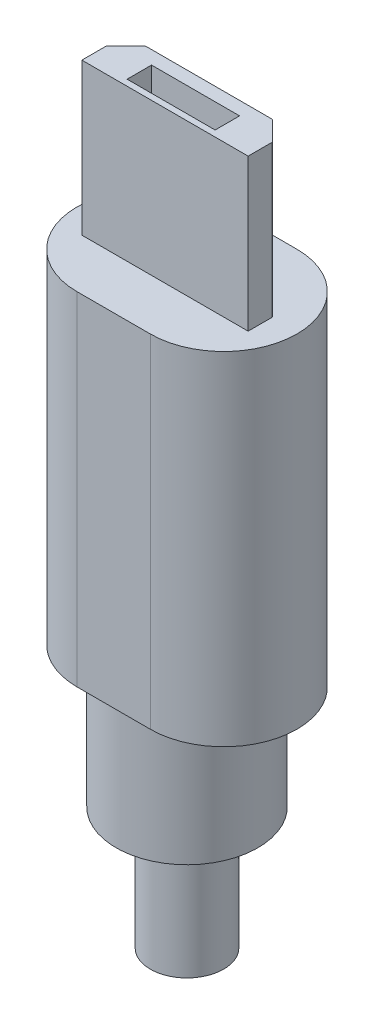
ISO-10303-21;
HEADER;
FILE_DESCRIPTION(('STEP AP214'),'2;1');
FILE_NAME('part.step','',(''),(''),'','','');
FILE_SCHEMA(('AUTOMOTIVE_DESIGN { 1 0 10303 214 1 1 1 1 }'));
ENDSEC;
DATA;
#1=APPLICATION_CONTEXT('core data for automotive mechanical design processes');
#2=APPLICATION_PROTOCOL_DEFINITION('international standard','automotive_design',2000,#1);
#3=PRODUCT_CONTEXT('',#1,'mechanical');
#4=PRODUCT('Part','Part','',(#3));
#5=PRODUCT_RELATED_PRODUCT_CATEGORY('part','',(#4));
#6=PRODUCT_DEFINITION_FORMATION('','',#4);
#7=PRODUCT_DEFINITION_CONTEXT('part definition',#1,'design');
#8=PRODUCT_DEFINITION('design','',#6,#7);
#9=PRODUCT_DEFINITION_SHAPE('','',#8);
#10=(LENGTH_UNIT() NAMED_UNIT(*) SI_UNIT(.MILLI.,.METRE.));
#11=(NAMED_UNIT(*) PLANE_ANGLE_UNIT() SI_UNIT($,.RADIAN.));
#12=(NAMED_UNIT(*) SI_UNIT($,.STERADIAN.) SOLID_ANGLE_UNIT());
#13=UNCERTAINTY_MEASURE_WITH_UNIT(LENGTH_MEASURE(1.E-05),#10,'distance_accuracy_value','');
#14=(GEOMETRIC_REPRESENTATION_CONTEXT(3) GLOBAL_UNCERTAINTY_ASSIGNED_CONTEXT((#13)) GLOBAL_UNIT_ASSIGNED_CONTEXT((#10,
#11,#12)) REPRESENTATION_CONTEXT('',''));
#15=CARTESIAN_POINT('',(0.,0.,0.));
#16=DIRECTION('',(0.,0.,1.));
#17=DIRECTION('',(1.,0.,0.));
#18=AXIS2_PLACEMENT_3D('',#15,#16,#17);
#19=CARTESIAN_POINT('',(-1.5,14.,-3.));
#20=DIRECTION('',(0.,0.,1.));
#21=DIRECTION('',(1.,0.,0.));
#22=AXIS2_PLACEMENT_3D('',#19,#20,#21);
#23=PLANE('',#22);
#24=DIRECTION('',(0.,-1.,0.));
#25=VECTOR('',#24,1.);
#26=CARTESIAN_POINT('',(-1.5,14.,-3.));
#27=LINE('',#26,#25);
#28=CARTESIAN_POINT('',(-1.5,8.51845859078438,-3.));
#29=VERTEX_POINT('',#28);
#30=CARTESIAN_POINT('',(-1.5,0.,-3.));
#31=VERTEX_POINT('',#30);
#32=EDGE_CURVE('E846',#29,#31,#27,.T.);
#33=ORIENTED_EDGE('',*,*,#32,.F.);
#34=DIRECTION('',(-1.,0.,0.));
#35=VECTOR('',#34,1.);
#36=CARTESIAN_POINT('',(-1.20433611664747,8.51845859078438,-3.));
#37=LINE('',#36,#35);
#38=CARTESIAN_POINT('',(-1.20433611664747,8.51845859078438,-3.));
#39=VERTEX_POINT('',#38);
#40=EDGE_CURVE('E570',#39,#29,#37,.T.);
#41=ORIENTED_EDGE('',*,*,#40,.F.);
#42=DIRECTION('',(0.,1.,0.));
#43=VECTOR('',#42,1.);
#44=CARTESIAN_POINT('',(-1.20433611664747,8.51845859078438,-3.));
#45=LINE('',#44,#43);
#46=CARTESIAN_POINT('',(-1.20433611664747,7.71497021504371,-3.));
#47=VERTEX_POINT('',#46);
#48=EDGE_CURVE('E566',#47,#39,#45,.T.);
#49=ORIENTED_EDGE('',*,*,#48,.F.);
#50=CARTESIAN_POINT('',(-0.442336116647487,7.71497021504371,-3.));
#51=DIRECTION('',(0.,0.,-1.));
#52=DIRECTION('',(1.,0.,0.));
#53=AXIS2_PLACEMENT_3D('',#50,#51,#52);
#54=CIRCLE('',#53,0.761999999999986);
#55=CARTESIAN_POINT('',(-1.05311890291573,7.2593515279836,-3.));
#56=VERTEX_POINT('',#55);
#57=EDGE_CURVE('E562',#56,#47,#54,.T.);
#58=ORIENTED_EDGE('',*,*,#57,.F.);
#59=DIRECTION('',(-0.59792478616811,0.801552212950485,0.));
#60=VECTOR('',#59,1.);
#61=CARTESIAN_POINT('',(-1.05311890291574,7.2593515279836,-3.));
#62=LINE('',#61,#60);
#63=CARTESIAN_POINT('',(-0.177405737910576,6.08540817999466,-3.));
#64=VERTEX_POINT('',#63);
#65=EDGE_CURVE('E558',#64,#56,#62,.T.);
#66=ORIENTED_EDGE('',*,*,#65,.F.);
#67=CARTESIAN_POINT('',(-0.381000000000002,5.93353528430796,-3.));
#68=DIRECTION('',(0.,0.,1.));
#69=DIRECTION('',(-1.,0.,0.));
#70=AXIS2_PLACEMENT_3D('',#67,#68,#69);
#71=CIRCLE('',#70,0.254000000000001);
#72=CARTESIAN_POINT('',(-0.127000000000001,5.93353528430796,-3.));
#73=VERTEX_POINT('',#72);
#74=EDGE_CURVE('E554',#73,#64,#71,.T.);
#75=ORIENTED_EDGE('',*,*,#74,.F.);
#76=DIRECTION('',(0.,1.,0.));
#77=VECTOR('',#76,1.);
#78=CARTESIAN_POINT('',(-0.127000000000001,3.56953500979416,-3.));
#79=LINE('',#78,#77);
#80=CARTESIAN_POINT('',(-0.127000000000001,3.56953500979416,-3.));
#81=VERTEX_POINT('',#80);
#82=EDGE_CURVE('E550',#81,#73,#79,.T.);
#83=ORIENTED_EDGE('',*,*,#82,.F.);
#84=CARTESIAN_POINT('',(0.,2.94736461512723,-3.));
#85=DIRECTION('',(0.,0.,-1.));
#86=DIRECTION('',(-1.,0.,0.));
#87=AXIS2_PLACEMENT_3D('',#84,#85,#86);
#88=CIRCLE('',#87,0.635);
#89=CARTESIAN_POINT('',(0.127,3.56953500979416,-3.));
#90=VERTEX_POINT('',#89);
#91=EDGE_CURVE('E546',#90,#81,#88,.T.);
#92=ORIENTED_EDGE('',*,*,#91,.F.);
#93=DIRECTION('',(0.,-1.,0.));
#94=VECTOR('',#93,1.);
#95=CARTESIAN_POINT('',(0.127,3.56953500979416,-3.));
#96=LINE('',#95,#94);
#97=CARTESIAN_POINT('',(0.127,4.84485799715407,-3.));
#98=VERTEX_POINT('',#97);
#99=EDGE_CURVE('E542',#98,#90,#96,.T.);
#100=ORIENTED_EDGE('',*,*,#99,.F.);
#101=CARTESIAN_POINT('',(0.381000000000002,4.84485799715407,-3.));
#102=DIRECTION('',(0.,0.,1.));
#103=DIRECTION('',(-1.,0.,0.));
#104=AXIS2_PLACEMENT_3D('',#101,#102,#103);
#105=CIRCLE('',#104,0.254000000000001);
#106=CARTESIAN_POINT('',(0.219161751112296,5.04062413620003,-3.));
#107=VERTEX_POINT('',#106);
#108=EDGE_CURVE('E538',#107,#98,#105,.T.);
#109=ORIENTED_EDGE('',*,*,#108,.F.);
#110=DIRECTION('',(-0.770732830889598,-0.637158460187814,0.));
#111=VECTOR('',#110,1.);
#112=CARTESIAN_POINT('',(0.219161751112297,5.04062413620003,-3.));
#113=LINE('',#112,#111);
#114=CARTESIAN_POINT('',(1.26700709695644,5.90686922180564,-3.));
#115=VERTEX_POINT('',#114);
#116=EDGE_CURVE('E534',#115,#107,#113,.T.);
#117=ORIENTED_EDGE('',*,*,#116,.F.);
#118=CARTESIAN_POINT('',(0.592706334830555,6.72253089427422,-3.));
#119=DIRECTION('',(0.,0.,1.));
#120=DIRECTION('',(1.,0.,0.));
#121=AXIS2_PLACEMENT_3D('',#118,#119,#120);
#122=CIRCLE('',#121,1.05829366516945);
#123=CARTESIAN_POINT('',(1.5,6.17773397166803,-3.));
#124=VERTEX_POINT('',#123);
#125=EDGE_CURVE('E935',#115,#124,#122,.T.);
#126=ORIENTED_EDGE('',*,*,#125,.T.);
#127=DIRECTION('',(0.,-1.,0.));
#128=VECTOR('',#127,1.);
#129=CARTESIAN_POINT('',(1.5,14.,-3.));
#130=LINE('',#129,#128);
#131=CARTESIAN_POINT('',(1.5,0.,-3.));
#132=VERTEX_POINT('',#131);
#133=EDGE_CURVE('E860',#124,#132,#130,.T.);
#134=ORIENTED_EDGE('',*,*,#133,.T.);
#135=DIRECTION('',(-1.,0.,0.));
#136=VECTOR('',#135,1.);
#137=CARTESIAN_POINT('',(-1.5,0.,-3.));
#138=LINE('',#137,#136);
#139=EDGE_CURVE('E849',#132,#31,#138,.T.);
#140=ORIENTED_EDGE('',*,*,#139,.T.);
#141=EDGE_LOOP('',(#33,#41,#49,#58,#66,#75,#83,#92,#100,#109,#117,#126,#134,#140));
#142=FACE_BOUND('',#141,.T.);
#143=ADVANCED_FACE('F51',(#142),#23,.F.);
#144=CARTESIAN_POINT('',(-1.5,14.,0.));
#145=DIRECTION('',(0.,-1.,0.));
#146=DIRECTION('',(0.,0.,-1.));
#147=AXIS2_PLACEMENT_3D('',#144,#145,#146);
#148=CYLINDRICAL_SURFACE('',#147,3.);
#149=CARTESIAN_POINT('',(-1.5,14.,-3.));
#150=VERTEX_POINT('',#149);
#151=CARTESIAN_POINT('',(-1.5,9.40745859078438,-3.));
#152=VERTEX_POINT('',#151);
#153=EDGE_CURVE('E854',#150,#152,#27,.T.);
#154=ORIENTED_EDGE('',*,*,#153,.T.);
#155=CARTESIAN_POINT('',(-1.5,9.40745859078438,0.));
#156=DIRECTION('',(0.,1.,0.));
#157=DIRECTION('',(0.,0.,1.));
#158=AXIS2_PLACEMENT_3D('',#155,#156,#157);
#159=CIRCLE('',#158,3.);
#160=CARTESIAN_POINT('',(-1.524,9.40745859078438,-2.99990399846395));
#161=VERTEX_POINT('',#160);
#162=EDGE_CURVE('E1091',#152,#161,#159,.T.);
#163=ORIENTED_EDGE('',*,*,#162,.T.);
#164=DIRECTION('',(0.,-1.,0.));
#165=VECTOR('',#164,1.);
#166=CARTESIAN_POINT('',(-1.524,14.,-2.99990399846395));
#167=LINE('',#166,#165);
#168=CARTESIAN_POINT('',(-1.524,8.51845859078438,-2.99990399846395));
#169=VERTEX_POINT('',#168);
#170=EDGE_CURVE('E11',#161,#169,#167,.T.);
#171=ORIENTED_EDGE('',*,*,#170,.T.);
#172=CARTESIAN_POINT('',(-1.5,8.51845859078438,0.));
#173=DIRECTION('',(0.,-1.,0.));
#174=DIRECTION('',(0.,0.,-1.));
#175=AXIS2_PLACEMENT_3D('',#172,#173,#174);
#176=CIRCLE('',#175,3.);
#177=EDGE_CURVE('E1094',#169,#29,#176,.T.);
#178=ORIENTED_EDGE('',*,*,#177,.T.);
#179=ORIENTED_EDGE('',*,*,#32,.T.);
#180=CARTESIAN_POINT('',(-1.5,0.,0.));
#181=DIRECTION('',(0.,1.,0.));
#182=DIRECTION('',(0.,0.,1.));
#183=AXIS2_PLACEMENT_3D('',#180,#181,#182);
#184=CIRCLE('',#183,3.);
#185=CARTESIAN_POINT('',(-1.5,0.,3.));
#186=VERTEX_POINT('',#185);
#187=EDGE_CURVE('E968',#31,#186,#184,.T.);
#188=ORIENTED_EDGE('',*,*,#187,.T.);
#189=DIRECTION('',(0.,-1.,0.));
#190=VECTOR('',#189,1.);
#191=CARTESIAN_POINT('',(-1.5,14.,3.));
#192=LINE('',#191,#190);
#193=CARTESIAN_POINT('',(-1.5,14.,3.));
#194=VERTEX_POINT('',#193);
#195=EDGE_CURVE('E874',#194,#186,#192,.T.);
#196=ORIENTED_EDGE('',*,*,#195,.F.);
#197=CARTESIAN_POINT('',(-1.5,14.,0.));
#198=DIRECTION('',(0.,1.,0.));
#199=DIRECTION('',(0.,0.,1.));
#200=AXIS2_PLACEMENT_3D('',#197,#198,#199);
#201=CIRCLE('',#200,3.);
#202=EDGE_CURVE('E964',#150,#194,#201,.T.);
#203=ORIENTED_EDGE('',*,*,#202,.F.);
#204=EDGE_LOOP('',(#154,#163,#171,#178,#179,#188,#196,#203));
#205=FACE_BOUND('',#204,.T.);
#206=ADVANCED_FACE('F836',(#205),#148,.T.);
#207=CARTESIAN_POINT('',(-1.5,14.,3.));
#208=DIRECTION('',(0.,0.,-1.));
#209=DIRECTION('',(-1.,0.,0.));
#210=AXIS2_PLACEMENT_3D('',#207,#208,#209);
#211=PLANE('',#210);
#212=DIRECTION('',(1.,0.,0.));
#213=VECTOR('',#212,1.);
#214=CARTESIAN_POINT('',(-1.5,0.,3.));
#215=LINE('',#214,#213);
#216=CARTESIAN_POINT('',(1.5,0.,3.));
#217=VERTEX_POINT('',#216);
#218=EDGE_CURVE('E971',#186,#217,#215,.T.);
#219=ORIENTED_EDGE('',*,*,#218,.T.);
#220=DIRECTION('',(0.,-1.,0.));
#221=VECTOR('',#220,1.);
#222=CARTESIAN_POINT('',(1.5,14.,3.));
#223=LINE('',#222,#221);
#224=CARTESIAN_POINT('',(1.5,14.,3.));
#225=VERTEX_POINT('',#224);
#226=EDGE_CURVE('E870',#225,#217,#223,.T.);
#227=ORIENTED_EDGE('',*,*,#226,.F.);
#228=DIRECTION('',(1.,0.,0.));
#229=VECTOR('',#228,1.);
#230=CARTESIAN_POINT('',(-1.5,14.,3.));
#231=LINE('',#230,#229);
#232=EDGE_CURVE('E961',#194,#225,#231,.T.);
#233=ORIENTED_EDGE('',*,*,#232,.F.);
#234=ORIENTED_EDGE('',*,*,#195,.T.);
#235=EDGE_LOOP('',(#219,#227,#233,#234));
#236=FACE_BOUND('',#235,.T.);
#237=ADVANCED_FACE('F832',(#236),#211,.F.);
#238=CARTESIAN_POINT('',(1.5,14.,0.));
#239=DIRECTION('',(0.,-1.,0.));
#240=DIRECTION('',(0.,0.,-1.));
#241=AXIS2_PLACEMENT_3D('',#238,#239,#240);
#242=CYLINDRICAL_SURFACE('',#241,3.);
#243=ORIENTED_EDGE('',*,*,#133,.F.);
#244=CARTESIAN_POINT('',(1.5,6.17773397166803,-3.));
#245=CARTESIAN_POINT('',(1.51548883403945,6.20353092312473,-2.99999870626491));
#246=CARTESIAN_POINT('',(1.52986898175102,6.22997209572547,-2.99988029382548));
#247=CARTESIAN_POINT('',(1.55633042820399,6.28398728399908,-2.99950047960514));
#248=CARTESIAN_POINT('',(1.56841120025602,6.31156155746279,-2.99923904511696));
#249=CARTESIAN_POINT('',(1.60056618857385,6.39442806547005,-2.99839060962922));
#250=CARTESIAN_POINT('',(1.61727855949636,6.45107953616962,-2.99773086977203));
#251=CARTESIAN_POINT('',(1.63637406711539,6.54358918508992,-2.99690712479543));
#252=CARTESIAN_POINT('',(1.64180801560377,6.57885668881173,-2.9966502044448));
#253=CARTESIAN_POINT('',(1.64914611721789,6.65024842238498,-2.99629109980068));
#254=CARTESIAN_POINT('',(1.65100067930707,6.68637776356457,-2.99619109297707));
#255=CARTESIAN_POINT('',(1.651,6.72253089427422,-2.99619742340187));
#256=B_SPLINE_CURVE_WITH_KNOTS('',3,(#244,#245,#246,#247,#248,#249,#250,#251,#252,#253,#254,
#255),.UNSPECIFIED.,.F.,.F.,(4,2,2,2,2,4),(0.,0.0902050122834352,0.180430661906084,
0.356687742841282,0.463581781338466,0.571946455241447),.UNSPECIFIED.);
#257=CARTESIAN_POINT('',(1.651,6.72253089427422,-2.99619742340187));
#258=VERTEX_POINT('',#257);
#259=EDGE_CURVE('E721',#124,#258,#256,.T.);
#260=ORIENTED_EDGE('',*,*,#259,.T.);
#261=DIRECTION('',(0.,-1.,0.));
#262=VECTOR('',#261,1.);
#263=CARTESIAN_POINT('',(1.651,14.,-2.99619742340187));
#264=LINE('',#263,#262);
#265=CARTESIAN_POINT('',(1.651,7.96308970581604,-2.99619742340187));
#266=VERTEX_POINT('',#265);
#267=EDGE_CURVE('E60',#258,#266,#264,.F.);
#268=ORIENTED_EDGE('',*,*,#267,.T.);
#269=CARTESIAN_POINT('',(1.651,7.96308970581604,-2.99619742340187));
#270=CARTESIAN_POINT('',(1.67871104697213,7.97022088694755,-2.99481225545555));
#271=CARTESIAN_POINT('',(1.7057752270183,7.97972785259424,-2.99305160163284));
#272=CARTESIAN_POINT('',(1.75787613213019,8.0031025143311,-2.98900719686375));
#273=CARTESIAN_POINT('',(1.78291493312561,8.01696567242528,-2.98672399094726));
#274=CARTESIAN_POINT('',(1.83029527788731,8.04868057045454,-2.98185818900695));
#275=CARTESIAN_POINT('',(1.85263642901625,8.06653288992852,-2.97927554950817));
#276=CARTESIAN_POINT('',(1.89401286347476,8.10572233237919,-2.97408609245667));
#277=CARTESIAN_POINT('',(1.91304826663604,8.12705932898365,-2.97147927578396));
#278=CARTESIAN_POINT('',(1.94739334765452,8.17278027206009,-2.96650356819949));
#279=CARTESIAN_POINT('',(1.96267952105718,8.19718205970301,-2.96413623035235));
#280=CARTESIAN_POINT('',(1.98893141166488,8.24825338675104,-2.95991952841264));
#281=CARTESIAN_POINT('',(1.99989691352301,8.27492303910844,-2.95807019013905));
#282=CARTESIAN_POINT('',(2.01710647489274,8.32956251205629,-2.95511035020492));
#283=CARTESIAN_POINT('',(2.02338556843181,8.35752099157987,-2.95399437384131));
#284=CARTESIAN_POINT('',(2.03115998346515,8.4141136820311,-2.95260648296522));
#285=CARTESIAN_POINT('',(2.0326559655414,8.44274779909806,-2.952334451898));
#286=CARTESIAN_POINT('',(2.03083058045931,8.49946830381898,-2.95266312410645));
#287=CARTESIAN_POINT('',(2.02757394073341,8.52755686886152,-2.95325210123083));
#288=CARTESIAN_POINT('',(2.01646219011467,8.58277993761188,-2.95521542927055));
#289=CARTESIAN_POINT('',(2.00860701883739,8.60991442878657,-2.95658979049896));
#290=CARTESIAN_POINT('',(1.98852373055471,8.66250354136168,-2.95997426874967));
#291=CARTESIAN_POINT('',(1.97629081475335,8.68795628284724,-2.96198508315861));
#292=CARTESIAN_POINT('',(1.94780454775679,8.73646348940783,-2.96642513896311));
#293=CARTESIAN_POINT('',(1.93155074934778,8.75951768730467,-2.96885442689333));
#294=CARTESIAN_POINT('',(1.895215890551,8.8029166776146,-2.97391066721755));
#295=CARTESIAN_POINT('',(1.87508445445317,8.82321903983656,-2.97653990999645));
#296=CARTESIAN_POINT('',(1.83169665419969,8.86017306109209,-2.98168637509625));
#297=CARTESIAN_POINT('',(1.80844015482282,8.87682456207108,-2.98420359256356));
#298=CARTESIAN_POINT('',(1.75928744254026,8.90609849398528,-2.98887646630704));
#299=CARTESIAN_POINT('',(1.73337589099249,8.91869554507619,-2.99102980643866));
#300=CARTESIAN_POINT('',(1.67976304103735,8.9393405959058,-2.99472964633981));
#301=CARTESIAN_POINT('',(1.65206262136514,8.94739081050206,-2.99627644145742));
#302=CARTESIAN_POINT('',(1.60352538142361,8.95712507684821,-2.99828243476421));
#303=CARTESIAN_POINT('',(1.58291866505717,8.95995618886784,-2.99892437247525));
#304=CARTESIAN_POINT('',(1.5415242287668,8.96308116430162,-2.99978498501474));
#305=CARTESIAN_POINT('',(1.52073669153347,8.9633773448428,-3.00000404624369));
#306=CARTESIAN_POINT('',(1.5,8.9623913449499,-3.));
#307=B_SPLINE_CURVE_WITH_KNOTS('',3,(#269,#270,#271,#272,#273,#274,#275,#276,#277,#278,#279,
#280,#281,#282,#283,#284,#285,#286,#287,#288,#289,#290,#291,#292,#293,#294,#295,#296,#297,#298,
#299,#300,#301,#302,#303,#304,#305,#306),.UNSPECIFIED.,.F.,.F.,(4,2,2,2,2,2,2,2,2,2,2,2,2,2,2,2,
2,2,4),(0.,0.0858159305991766,0.171542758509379,0.257282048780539,0.343018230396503,
0.429278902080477,0.515543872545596,0.601157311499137,0.686758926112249,0.771205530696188,
0.855653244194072,0.940193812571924,1.02474378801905,1.11047695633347,1.19621383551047,
1.28247741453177,1.36869893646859,1.43097730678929,1.49319874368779),.UNSPECIFIED.);
#308=CARTESIAN_POINT('',(1.5,8.9623913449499,-3.));
#309=VERTEX_POINT('',#308);
#310=EDGE_CURVE('E619',#266,#309,#307,.T.);
#311=ORIENTED_EDGE('',*,*,#310,.T.);
#312=CARTESIAN_POINT('',(1.5,14.,-3.));
#313=VERTEX_POINT('',#312);
#314=EDGE_CURVE('E866',#313,#309,#130,.T.);
#315=ORIENTED_EDGE('',*,*,#314,.F.);
#316=CARTESIAN_POINT('',(1.5,14.,0.));
#317=DIRECTION('',(0.,1.,0.));
#318=DIRECTION('',(0.,0.,1.));
#319=AXIS2_PLACEMENT_3D('',#316,#317,#318);
#320=CIRCLE('',#319,3.);
#321=EDGE_CURVE('E861',#225,#313,#320,.T.);
#322=ORIENTED_EDGE('',*,*,#321,.F.);
#323=ORIENTED_EDGE('',*,*,#226,.T.);
#324=CARTESIAN_POINT('',(1.5,0.,0.));
#325=DIRECTION('',(0.,1.,0.));
#326=DIRECTION('',(0.,0.,1.));
#327=AXIS2_PLACEMENT_3D('',#324,#325,#326);
#328=CIRCLE('',#327,3.);
#329=EDGE_CURVE('E974',#217,#132,#328,.T.);
#330=ORIENTED_EDGE('',*,*,#329,.T.);
#331=EDGE_LOOP('',(#243,#260,#268,#311,#315,#322,#323,#330));
#332=FACE_BOUND('',#331,.T.);
#333=ADVANCED_FACE('F728',(#332),#242,.T.);
#334=DIRECTION('',(0.,-1.,0.));
#335=VECTOR('',#334,1.);
#336=CARTESIAN_POINT('',(-0.635,9.40745859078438,-3.));
#337=LINE('',#336,#335);
#338=CARTESIAN_POINT('',(-0.635,9.40745859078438,-3.));
#339=VERTEX_POINT('',#338);
#340=CARTESIAN_POINT('',(-0.635,8.51845859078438,-3.));
#341=VERTEX_POINT('',#340);
#342=EDGE_CURVE('E573',#339,#341,#337,.T.);
#343=ORIENTED_EDGE('',*,*,#342,.F.);
#344=DIRECTION('',(-1.,0.,0.));
#345=VECTOR('',#344,1.);
#346=CARTESIAN_POINT('',(-1.5,9.40745859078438,-3.));
#347=LINE('',#346,#345);
#348=EDGE_CURVE('E931',#339,#152,#347,.T.);
#349=ORIENTED_EDGE('',*,*,#348,.T.);
#350=ORIENTED_EDGE('',*,*,#153,.F.);
#351=DIRECTION('',(-1.,0.,0.));
#352=VECTOR('',#351,1.);
#353=CARTESIAN_POINT('',(-1.5,14.,-3.));
#354=LINE('',#353,#352);
#355=EDGE_CURVE('E855',#313,#150,#354,.T.);
#356=ORIENTED_EDGE('',*,*,#355,.F.);
#357=ORIENTED_EDGE('',*,*,#314,.T.);
#358=CARTESIAN_POINT('',(1.524,8.45495859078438,-3.));
#359=DIRECTION('',(0.,0.,-1.));
#360=DIRECTION('',(-1.,0.,0.));
#361=AXIS2_PLACEMENT_3D('',#358,#359,#360);
#362=CIRCLE('',#361,0.508000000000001);
#363=CARTESIAN_POINT('',(1.397,7.96308970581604,-3.));
#364=VERTEX_POINT('',#363);
#365=EDGE_CURVE('E531',#364,#309,#362,.T.);
#366=ORIENTED_EDGE('',*,*,#365,.F.);
#367=DIRECTION('',(0.,1.,0.));
#368=VECTOR('',#367,1.);
#369=CARTESIAN_POINT('',(1.397,6.70262010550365,-3.));
#370=LINE('',#369,#368);
#371=CARTESIAN_POINT('',(1.397,6.70262010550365,-3.));
#372=VERTEX_POINT('',#371);
#373=EDGE_CURVE('E527',#372,#364,#370,.T.);
#374=ORIENTED_EDGE('',*,*,#373,.F.);
#375=CARTESIAN_POINT('',(0.635,6.70262010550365,-3.));
#376=DIRECTION('',(0.,0.,1.));
#377=DIRECTION('',(-1.,0.,0.));
#378=AXIS2_PLACEMENT_3D('',#375,#376,#377);
#379=CIRCLE('',#378,0.762);
#380=CARTESIAN_POINT('',(1.12051474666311,6.11532168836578,-3.));
#381=VERTEX_POINT('',#380);
#382=EDGE_CURVE('E523',#381,#372,#379,.T.);
#383=ORIENTED_EDGE('',*,*,#382,.F.);
#384=DIRECTION('',(0.770732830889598,0.637158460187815,0.));
#385=VECTOR('',#384,1.);
#386=CARTESIAN_POINT('',(0.210167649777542,5.36274526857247,-3.));
#387=LINE('',#386,#385);
#388=CARTESIAN_POINT('',(0.210167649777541,5.36274526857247,-3.));
#389=VERTEX_POINT('',#388);
#390=EDGE_CURVE('E520',#389,#381,#387,.T.);
#391=ORIENTED_EDGE('',*,*,#390,.F.);
#392=CARTESIAN_POINT('',(0.1778,5.40189849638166,-3.));
#393=DIRECTION('',(0.,0.,1.));
#394=DIRECTION('',(1.,0.,0.));
#395=AXIS2_PLACEMENT_3D('',#392,#393,#394);
#396=CIRCLE('',#395,0.0508000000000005);
#397=CARTESIAN_POINT('',(0.127,5.40189849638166,-3.));
#398=VERTEX_POINT('',#397);
#399=EDGE_CURVE('E67',#398,#389,#396,.T.);
#400=ORIENTED_EDGE('',*,*,#399,.F.);
#401=DIRECTION('',(0.,-1.,0.));
#402=VECTOR('',#401,1.);
#403=CARTESIAN_POINT('',(0.127,5.40189849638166,-3.));
#404=LINE('',#403,#402);
#405=CARTESIAN_POINT('',(0.127,10.8097184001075,-3.));
#406=VERTEX_POINT('',#405);
#407=EDGE_CURVE('E400',#406,#398,#404,.T.);
#408=ORIENTED_EDGE('',*,*,#407,.F.);
#409=DIRECTION('',(-1.,0.,0.));
#410=VECTOR('',#409,1.);
#411=CARTESIAN_POINT('',(0.716956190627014,10.8097184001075,-3.));
#412=LINE('',#411,#410);
#413=CARTESIAN_POINT('',(0.716956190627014,10.8097184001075,-3.));
#414=VERTEX_POINT('',#413);
#415=EDGE_CURVE('E404',#414,#406,#412,.T.);
#416=ORIENTED_EDGE('',*,*,#415,.F.);
#417=DIRECTION('',(0.705665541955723,-0.708545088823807,0.));
#418=VECTOR('',#417,1.);
#419=CARTESIAN_POINT('',(0.,11.5296002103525,-3.));
#420=LINE('',#419,#418);
#421=CARTESIAN_POINT('',(0.,11.5296002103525,-3.));
#422=VERTEX_POINT('',#421);
#423=EDGE_CURVE('E609',#422,#414,#420,.T.);
#424=ORIENTED_EDGE('',*,*,#423,.F.);
#425=DIRECTION('',(0.705665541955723,0.708545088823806,0.));
#426=VECTOR('',#425,1.);
#427=CARTESIAN_POINT('',(-0.716956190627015,10.8097184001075,-3.));
#428=LINE('',#427,#426);
#429=CARTESIAN_POINT('',(-0.716956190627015,10.8097184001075,-3.));
#430=VERTEX_POINT('',#429);
#431=EDGE_CURVE('E605',#430,#422,#428,.T.);
#432=ORIENTED_EDGE('',*,*,#431,.F.);
#433=DIRECTION('',(-1.,0.,0.));
#434=VECTOR('',#433,1.);
#435=CARTESIAN_POINT('',(-0.127000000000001,10.8097184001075,-3.));
#436=LINE('',#435,#434);
#437=CARTESIAN_POINT('',(-0.127000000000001,10.8097184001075,-3.));
#438=VERTEX_POINT('',#437);
#439=EDGE_CURVE('E601',#438,#430,#436,.T.);
#440=ORIENTED_EDGE('',*,*,#439,.F.);
#441=DIRECTION('',(0.,1.,0.));
#442=VECTOR('',#441,1.);
#443=CARTESIAN_POINT('',(-0.127,6.58901001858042,-3.));
#444=LINE('',#443,#442);
#445=CARTESIAN_POINT('',(-0.127,6.58901001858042,-3.));
#446=VERTEX_POINT('',#445);
#447=EDGE_CURVE('E597',#446,#438,#444,.T.);
#448=ORIENTED_EDGE('',*,*,#447,.F.);
#449=CARTESIAN_POINT('',(-0.1778,6.58901001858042,-3.));
#450=DIRECTION('',(0.,0.,1.));
#451=DIRECTION('',(-1.,0.,0.));
#452=AXIS2_PLACEMENT_3D('',#449,#450,#451);
#453=CIRCLE('',#452,0.0507999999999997);
#454=CARTESIAN_POINT('',(-0.218518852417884,6.55863543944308,-3.));
#455=VERTEX_POINT('',#454);
#456=EDGE_CURVE('E593',#455,#446,#453,.T.);
#457=ORIENTED_EDGE('',*,*,#456,.F.);
#458=DIRECTION('',(0.597924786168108,-0.801552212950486,0.));
#459=VECTOR('',#458,1.);
#460=CARTESIAN_POINT('',(-0.218518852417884,6.55863543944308,-3.));
#461=LINE('',#460,#459);
#462=CARTESIAN_POINT('',(-0.803446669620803,7.34276447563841,-3.));
#463=VERTEX_POINT('',#462);
#464=EDGE_CURVE('E589',#463,#455,#461,.T.);
#465=ORIENTED_EDGE('',*,*,#464,.F.);
#466=CARTESIAN_POINT('',(-0.192663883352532,7.79838316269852,-3.));
#467=DIRECTION('',(0.,0.,1.));
#468=DIRECTION('',(1.,0.,0.));
#469=AXIS2_PLACEMENT_3D('',#466,#467,#468);
#470=CIRCLE('',#469,0.762000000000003);
#471=CARTESIAN_POINT('',(-0.954663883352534,7.79838316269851,-3.));
#472=VERTEX_POINT('',#471);
#473=EDGE_CURVE('E585',#472,#463,#470,.T.);
#474=ORIENTED_EDGE('',*,*,#473,.F.);
#475=DIRECTION('',(0.,-1.,0.));
#476=VECTOR('',#475,1.);
#477=CARTESIAN_POINT('',(-0.954663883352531,8.51845859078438,-3.));
#478=LINE('',#477,#476);
#479=CARTESIAN_POINT('',(-0.954663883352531,8.51845859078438,-3.));
#480=VERTEX_POINT('',#479);
#481=EDGE_CURVE('E581',#480,#472,#478,.T.);
#482=ORIENTED_EDGE('',*,*,#481,.F.);
#483=DIRECTION('',(-1.,0.,0.));
#484=VECTOR('',#483,1.);
#485=CARTESIAN_POINT('',(-0.635,8.51845859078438,-3.));
#486=LINE('',#485,#484);
#487=EDGE_CURVE('E577',#341,#480,#486,.T.);
#488=ORIENTED_EDGE('',*,*,#487,.F.);
#489=EDGE_LOOP('',(#343,#349,#350,#356,#357,#366,#374,#383,#391,#400,#408,#416,#424,#432,#440,
#448,#457,#465,#474,#482,#488));
#490=FACE_BOUND('',#489,.T.);
#491=ADVANCED_FACE('F824',(#490),#23,.F.);
#492=CARTESIAN_POINT('',(-1.5,14.,0.));
#493=DIRECTION('',(0.,1.,0.));
#494=DIRECTION('',(0.,0.,1.));
#495=AXIS2_PLACEMENT_3D('',#492,#493,#494);
#496=PLANE('',#495);
#497=DIRECTION('',(0.,0.,-1.));
#498=VECTOR('',#497,1.);
#499=CARTESIAN_POINT('',(3.4,14.,-0.100000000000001));
#500=LINE('',#499,#498);
#501=CARTESIAN_POINT('',(3.4,14.,0.9));
#502=VERTEX_POINT('',#501);
#503=CARTESIAN_POINT('',(3.4,14.,-0.0585786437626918));
#504=VERTEX_POINT('',#503);
#505=EDGE_CURVE('E1016',#502,#504,#500,.T.);
#506=ORIENTED_EDGE('',*,*,#505,.F.);
#507=DIRECTION('',(1.,0.,0.));
#508=VECTOR('',#507,1.);
#509=CARTESIAN_POINT('',(-3.4,14.,0.9));
#510=LINE('',#509,#508);
#511=CARTESIAN_POINT('',(-3.4,14.,0.9));
#512=VERTEX_POINT('',#511);
#513=EDGE_CURVE('E997',#512,#502,#510,.T.);
#514=ORIENTED_EDGE('',*,*,#513,.F.);
#515=DIRECTION('',(0.,0.,1.));
#516=VECTOR('',#515,1.);
#517=CARTESIAN_POINT('',(-3.4,14.,-0.0999999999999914));
#518=LINE('',#517,#516);
#519=CARTESIAN_POINT('',(-3.4,14.,-0.0585786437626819));
#520=VERTEX_POINT('',#519);
#521=EDGE_CURVE('E1002',#520,#512,#518,.T.);
#522=ORIENTED_EDGE('',*,*,#521,.F.);
#523=CARTESIAN_POINT('',(-3.3,14.,-0.058578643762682));
#524=DIRECTION('',(0.,1.,0.));
#525=DIRECTION('',(0.,0.,1.));
#526=AXIS2_PLACEMENT_3D('',#523,#524,#525);
#527=CIRCLE('',#526,0.1);
#528=CARTESIAN_POINT('',(-3.37071067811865,14.,-0.129289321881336));
#529=VERTEX_POINT('',#528);
#530=EDGE_CURVE('E75',#520,#529,#527,.F.);
#531=ORIENTED_EDGE('',*,*,#530,.T.);
#532=DIRECTION('',(-0.707106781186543,0.,0.707106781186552));
#533=VECTOR('',#532,1.);
#534=CARTESIAN_POINT('',(-3.4,14.,-0.0999999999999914));
#535=LINE('',#534,#533);
#536=CARTESIAN_POINT('',(-2.62928932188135,14.,-0.870710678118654));
#537=VERTEX_POINT('',#536);
#538=EDGE_CURVE('E1005',#537,#529,#535,.T.);
#539=ORIENTED_EDGE('',*,*,#538,.F.);
#540=CARTESIAN_POINT('',(-2.55857864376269,14.,-0.8));
#541=DIRECTION('',(0.,1.,0.));
#542=DIRECTION('',(0.,0.,1.));
#543=AXIS2_PLACEMENT_3D('',#540,#541,#542);
#544=CIRCLE('',#543,0.1);
#545=CARTESIAN_POINT('',(-2.55857864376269,14.,-0.9));
#546=VERTEX_POINT('',#545);
#547=EDGE_CURVE('E927',#537,#546,#544,.F.);
#548=ORIENTED_EDGE('',*,*,#547,.T.);
#549=DIRECTION('',(-1.,0.,0.));
#550=VECTOR('',#549,1.);
#551=CARTESIAN_POINT('',(-2.6,14.,-0.9));
#552=LINE('',#551,#550);
#553=CARTESIAN_POINT('',(2.55857864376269,14.,-0.9));
#554=VERTEX_POINT('',#553);
#555=EDGE_CURVE('E1008',#554,#546,#552,.T.);
#556=ORIENTED_EDGE('',*,*,#555,.F.);
#557=CARTESIAN_POINT('',(2.55857864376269,14.,-0.8));
#558=DIRECTION('',(0.,1.,0.));
#559=DIRECTION('',(0.,0.,1.));
#560=AXIS2_PLACEMENT_3D('',#557,#558,#559);
#561=CIRCLE('',#560,0.1);
#562=CARTESIAN_POINT('',(2.62928932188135,14.,-0.870710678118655));
#563=VERTEX_POINT('',#562);
#564=EDGE_CURVE('E922',#554,#563,#561,.F.);
#565=ORIENTED_EDGE('',*,*,#564,.T.);
#566=DIRECTION('',(-0.707106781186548,0.,-0.707106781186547));
#567=VECTOR('',#566,1.);
#568=CARTESIAN_POINT('',(2.6,14.,-0.9));
#569=LINE('',#568,#567);
#570=CARTESIAN_POINT('',(3.37071067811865,14.,-0.129289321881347));
#571=VERTEX_POINT('',#570);
#572=EDGE_CURVE('E1012',#571,#563,#569,.T.);
#573=ORIENTED_EDGE('',*,*,#572,.F.);
#574=CARTESIAN_POINT('',(3.3,14.,-0.0585786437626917));
#575=DIRECTION('',(0.,1.,0.));
#576=DIRECTION('',(0.,0.,1.));
#577=AXIS2_PLACEMENT_3D('',#574,#575,#576);
#578=CIRCLE('',#577,0.1);
#579=EDGE_CURVE('E919',#571,#504,#578,.F.);
#580=ORIENTED_EDGE('',*,*,#579,.T.);
#581=EDGE_LOOP('',(#506,#514,#522,#531,#539,#548,#556,#565,#573,#580));
#582=FACE_BOUND('',#581,.T.);
#583=ORIENTED_EDGE('',*,*,#202,.T.);
#584=ORIENTED_EDGE('',*,*,#232,.T.);
#585=ORIENTED_EDGE('',*,*,#321,.T.);
#586=ORIENTED_EDGE('',*,*,#355,.T.);
#587=EDGE_LOOP('',(#583,#584,#585,#586));
#588=FACE_BOUND('',#587,.T.);
#589=ADVANCED_FACE('F821',(#582,#588),#496,.T.);
#590=CARTESIAN_POINT('',(-1.5,0.,0.));
#591=DIRECTION('',(0.,1.,0.));
#592=DIRECTION('',(0.,0.,1.));
#593=AXIS2_PLACEMENT_3D('',#590,#591,#592);
#594=PLANE('',#593);
#595=CARTESIAN_POINT('',(0.,0.,0.));
#596=DIRECTION('',(0.,-1.,0.));
#597=DIRECTION('',(0.,0.,-1.));
#598=AXIS2_PLACEMENT_3D('',#595,#596,#597);
#599=CIRCLE('',#598,2.9);
#600=CARTESIAN_POINT('',(0.,0.,-2.9));
#601=VERTEX_POINT('',#600);
#602=EDGE_CURVE('E878',#601,#601,#599,.T.);
#603=ORIENTED_EDGE('',*,*,#602,.F.);
#604=EDGE_LOOP('',(#603));
#605=FACE_BOUND('',#604,.T.);
#606=ORIENTED_EDGE('',*,*,#187,.F.);
#607=ORIENTED_EDGE('',*,*,#139,.F.);
#608=ORIENTED_EDGE('',*,*,#329,.F.);
#609=ORIENTED_EDGE('',*,*,#218,.F.);
#610=EDGE_LOOP('',(#606,#607,#608,#609));
#611=FACE_BOUND('',#610,.T.);
#612=ADVANCED_FACE('F819',(#605,#611),#594,.F.);
#613=CARTESIAN_POINT('',(0.,-5.,0.));
#614=DIRECTION('',(0.,1.,0.));
#615=DIRECTION('',(0.,0.,1.));
#616=AXIS2_PLACEMENT_3D('',#613,#614,#615);
#617=CYLINDRICAL_SURFACE('',#616,2.9);
#618=CARTESIAN_POINT('',(0.,-5.,0.));
#619=DIRECTION('',(0.,-1.,0.));
#620=DIRECTION('',(0.,0.,-1.));
#621=AXIS2_PLACEMENT_3D('',#618,#619,#620);
#622=CIRCLE('',#621,2.9);
#623=CARTESIAN_POINT('',(0.,-5.,-2.9));
#624=VERTEX_POINT('',#623);
#625=EDGE_CURVE('E972',#624,#624,#622,.T.);
#626=ORIENTED_EDGE('',*,*,#625,.F.);
#627=EDGE_LOOP('',(#626));
#628=FACE_BOUND('',#627,.T.);
#629=ORIENTED_EDGE('',*,*,#602,.T.);
#630=EDGE_LOOP('',(#629));
#631=FACE_BOUND('',#630,.T.);
#632=ADVANCED_FACE('F815',(#628,#631),#617,.T.);
#633=CARTESIAN_POINT('',(0.,-5.,0.));
#634=DIRECTION('',(0.,-1.,0.));
#635=DIRECTION('',(0.,0.,-1.));
#636=AXIS2_PLACEMENT_3D('',#633,#634,#635);
#637=PLANE('',#636);
#638=CARTESIAN_POINT('',(0.,-5.,0.));
#639=DIRECTION('',(0.,-1.,0.));
#640=DIRECTION('',(0.,0.,-1.));
#641=AXIS2_PLACEMENT_3D('',#638,#639,#640);
#642=CIRCLE('',#641,1.5);
#643=CARTESIAN_POINT('',(0.,-5.,-1.5));
#644=VERTEX_POINT('',#643);
#645=EDGE_CURVE('E930',#644,#644,#642,.T.);
#646=ORIENTED_EDGE('',*,*,#645,.F.);
#647=EDGE_LOOP('',(#646));
#648=FACE_BOUND('',#647,.T.);
#649=ORIENTED_EDGE('',*,*,#625,.T.);
#650=EDGE_LOOP('',(#649));
#651=FACE_BOUND('',#650,.T.);
#652=ADVANCED_FACE('F811',(#648,#651),#637,.T.);
#653=CARTESIAN_POINT('',(3.4,20.2,-0.100000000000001));
#654=DIRECTION('',(-1.,0.,0.));
#655=DIRECTION('',(0.,0.,1.));
#656=AXIS2_PLACEMENT_3D('',#653,#654,#655);
#657=PLANE('',#656);
#658=ORIENTED_EDGE('',*,*,#505,.T.);
#659=DIRECTION('',(0.,-1.,0.));
#660=VECTOR('',#659,1.);
#661=CARTESIAN_POINT('',(3.4,20.2,-0.0585786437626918));
#662=LINE('',#661,#660);
#663=CARTESIAN_POINT('',(3.4,20.2,-0.0585786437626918));
#664=VERTEX_POINT('',#663);
#665=EDGE_CURVE('E886',#504,#664,#662,.F.);
#666=ORIENTED_EDGE('',*,*,#665,.T.);
#667=DIRECTION('',(0.,0.,-1.));
#668=VECTOR('',#667,1.);
#669=CARTESIAN_POINT('',(3.4,20.2,-0.100000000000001));
#670=LINE('',#669,#668);
#671=CARTESIAN_POINT('',(3.4,20.2,0.9));
#672=VERTEX_POINT('',#671);
#673=EDGE_CURVE('E1001',#672,#664,#670,.T.);
#674=ORIENTED_EDGE('',*,*,#673,.F.);
#675=DIRECTION('',(0.,-1.,0.));
#676=VECTOR('',#675,1.);
#677=CARTESIAN_POINT('',(3.4,20.2,0.9));
#678=LINE('',#677,#676);
#679=EDGE_CURVE('E992',#672,#502,#678,.T.);
#680=ORIENTED_EDGE('',*,*,#679,.T.);
#681=EDGE_LOOP('',(#658,#666,#674,#680));
#682=FACE_BOUND('',#681,.T.);
#683=ADVANCED_FACE('F807',(#682),#657,.F.);
#684=CARTESIAN_POINT('',(2.6,20.2,-0.9));
#685=DIRECTION('',(-0.707106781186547,0.,0.707106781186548));
#686=DIRECTION('',(0.707106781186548,0.,0.707106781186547));
#687=AXIS2_PLACEMENT_3D('',#684,#685,#686);
#688=PLANE('',#687);
#689=DIRECTION('',(-0.707106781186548,0.,-0.707106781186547));
#690=VECTOR('',#689,1.);
#691=CARTESIAN_POINT('',(2.6,20.2,-0.9));
#692=LINE('',#691,#690);
#693=CARTESIAN_POINT('',(3.37071067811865,20.2,-0.129289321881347));
#694=VERTEX_POINT('',#693);
#695=CARTESIAN_POINT('',(2.62928932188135,20.2,-0.870710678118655));
#696=VERTEX_POINT('',#695);
#697=EDGE_CURVE('E1034',#694,#696,#692,.T.);
#698=ORIENTED_EDGE('',*,*,#697,.F.);
#699=DIRECTION('',(0.,-1.,0.));
#700=VECTOR('',#699,1.);
#701=CARTESIAN_POINT('',(3.37071067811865,20.2,-0.129289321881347));
#702=LINE('',#701,#700);
#703=EDGE_CURVE('E882',#694,#571,#702,.T.);
#704=ORIENTED_EDGE('',*,*,#703,.T.);
#705=ORIENTED_EDGE('',*,*,#572,.T.);
#706=DIRECTION('',(0.,-1.,0.));
#707=VECTOR('',#706,1.);
#708=CARTESIAN_POINT('',(2.62928932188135,20.2,-0.870710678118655));
#709=LINE('',#708,#707);
#710=EDGE_CURVE('E879',#563,#696,#709,.F.);
#711=ORIENTED_EDGE('',*,*,#710,.T.);
#712=EDGE_LOOP('',(#698,#704,#705,#711));
#713=FACE_BOUND('',#712,.T.);
#714=ADVANCED_FACE('F803',(#713),#688,.F.);
#715=CARTESIAN_POINT('',(-2.6,20.2,-0.9));
#716=DIRECTION('',(0.,0.,1.));
#717=DIRECTION('',(1.,0.,0.));
#718=AXIS2_PLACEMENT_3D('',#715,#716,#717);
#719=PLANE('',#718);
#720=DIRECTION('',(-1.,0.,0.));
#721=VECTOR('',#720,1.);
#722=CARTESIAN_POINT('',(-2.6,20.2,-0.9));
#723=LINE('',#722,#721);
#724=CARTESIAN_POINT('',(2.55857864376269,20.2,-0.9));
#725=VERTEX_POINT('',#724);
#726=CARTESIAN_POINT('',(-2.55857864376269,20.2,-0.9));
#727=VERTEX_POINT('',#726);
#728=EDGE_CURVE('E1030',#725,#727,#723,.T.);
#729=ORIENTED_EDGE('',*,*,#728,.F.);
#730=DIRECTION('',(0.,-1.,0.));
#731=VECTOR('',#730,1.);
#732=CARTESIAN_POINT('',(2.55857864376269,20.2,-0.9));
#733=LINE('',#732,#731);
#734=EDGE_CURVE('E904',#725,#554,#733,.T.);
#735=ORIENTED_EDGE('',*,*,#734,.T.);
#736=ORIENTED_EDGE('',*,*,#555,.T.);
#737=DIRECTION('',(0.,-1.,0.));
#738=VECTOR('',#737,1.);
#739=CARTESIAN_POINT('',(-2.55857864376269,20.2,-0.9));
#740=LINE('',#739,#738);
#741=EDGE_CURVE('E901',#546,#727,#740,.F.);
#742=ORIENTED_EDGE('',*,*,#741,.T.);
#743=EDGE_LOOP('',(#729,#735,#736,#742));
#744=FACE_BOUND('',#743,.T.);
#745=ADVANCED_FACE('F799',(#744),#719,.F.);
#746=CARTESIAN_POINT('',(-3.4,20.2,-0.0999999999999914));
#747=DIRECTION('',(0.707106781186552,0.,0.707106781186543));
#748=DIRECTION('',(0.707106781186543,0.,-0.707106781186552));
#749=AXIS2_PLACEMENT_3D('',#746,#747,#748);
#750=PLANE('',#749);
#751=ORIENTED_EDGE('',*,*,#538,.T.);
#752=DIRECTION('',(0.,-1.,0.));
#753=VECTOR('',#752,1.);
#754=CARTESIAN_POINT('',(-3.37071067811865,20.2,-0.129289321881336));
#755=LINE('',#754,#753);
#756=CARTESIAN_POINT('',(-3.37071067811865,20.2,-0.129289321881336));
#757=VERTEX_POINT('',#756);
#758=EDGE_CURVE('E916',#529,#757,#755,.F.);
#759=ORIENTED_EDGE('',*,*,#758,.T.);
#760=DIRECTION('',(-0.707106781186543,0.,0.707106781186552));
#761=VECTOR('',#760,1.);
#762=CARTESIAN_POINT('',(-3.4,20.2,-0.0999999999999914));
#763=LINE('',#762,#761);
#764=CARTESIAN_POINT('',(-2.62928932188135,20.2,-0.870710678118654));
#765=VERTEX_POINT('',#764);
#766=EDGE_CURVE('E1026',#765,#757,#763,.T.);
#767=ORIENTED_EDGE('',*,*,#766,.F.);
#768=DIRECTION('',(0.,-1.,0.));
#769=VECTOR('',#768,1.);
#770=CARTESIAN_POINT('',(-2.62928932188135,20.2,-0.870710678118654));
#771=LINE('',#770,#769);
#772=EDGE_CURVE('E912',#765,#537,#771,.T.);
#773=ORIENTED_EDGE('',*,*,#772,.T.);
#774=EDGE_LOOP('',(#751,#759,#767,#773));
#775=FACE_BOUND('',#774,.T.);
#776=ADVANCED_FACE('F795',(#775),#750,.F.);
#777=CARTESIAN_POINT('',(-3.4,20.2,-0.0999999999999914));
#778=DIRECTION('',(1.,0.,0.));
#779=DIRECTION('',(0.,0.,-1.));
#780=AXIS2_PLACEMENT_3D('',#777,#778,#779);
#781=PLANE('',#780);
#782=DIRECTION('',(0.,0.,1.));
#783=VECTOR('',#782,1.);
#784=CARTESIAN_POINT('',(-3.4,20.2,-0.0999999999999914));
#785=LINE('',#784,#783);
#786=CARTESIAN_POINT('',(-3.4,20.2,-0.0585786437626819));
#787=VERTEX_POINT('',#786);
#788=CARTESIAN_POINT('',(-3.4,20.2,0.9));
#789=VERTEX_POINT('',#788);
#790=EDGE_CURVE('E1023',#787,#789,#785,.T.);
#791=ORIENTED_EDGE('',*,*,#790,.F.);
#792=DIRECTION('',(0.,-1.,0.));
#793=VECTOR('',#792,1.);
#794=CARTESIAN_POINT('',(-3.4,20.2,-0.0585786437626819));
#795=LINE('',#794,#793);
#796=EDGE_CURVE('E908',#787,#520,#795,.T.);
#797=ORIENTED_EDGE('',*,*,#796,.T.);
#798=ORIENTED_EDGE('',*,*,#521,.T.);
#799=DIRECTION('',(0.,-1.,0.));
#800=VECTOR('',#799,1.);
#801=CARTESIAN_POINT('',(-3.4,20.2,0.9));
#802=LINE('',#801,#800);
#803=EDGE_CURVE('E988',#789,#512,#802,.T.);
#804=ORIENTED_EDGE('',*,*,#803,.F.);
#805=EDGE_LOOP('',(#791,#797,#798,#804));
#806=FACE_BOUND('',#805,.T.);
#807=ADVANCED_FACE('F791',(#806),#781,.F.);
#808=CARTESIAN_POINT('',(-3.4,20.2,0.9));
#809=DIRECTION('',(0.,0.,-1.));
#810=DIRECTION('',(-1.,0.,0.));
#811=AXIS2_PLACEMENT_3D('',#808,#809,#810);
#812=PLANE('',#811);
#813=ORIENTED_EDGE('',*,*,#513,.T.);
#814=ORIENTED_EDGE('',*,*,#679,.F.);
#815=DIRECTION('',(1.,0.,0.));
#816=VECTOR('',#815,1.);
#817=CARTESIAN_POINT('',(-3.4,20.2,0.9));
#818=LINE('',#817,#816);
#819=EDGE_CURVE('E996',#789,#672,#818,.T.);
#820=ORIENTED_EDGE('',*,*,#819,.F.);
#821=ORIENTED_EDGE('',*,*,#803,.T.);
#822=EDGE_LOOP('',(#813,#814,#820,#821));
#823=FACE_BOUND('',#822,.T.);
#824=ADVANCED_FACE('F787',(#823),#812,.F.);
#825=CARTESIAN_POINT('',(0.,20.2,0.));
#826=DIRECTION('',(0.,1.,0.));
#827=DIRECTION('',(0.,0.,1.));
#828=AXIS2_PLACEMENT_3D('',#825,#826,#827);
#829=PLANE('',#828);
#830=DIRECTION('',(0.,0.,1.));
#831=VECTOR('',#830,1.);
#832=CARTESIAN_POINT('',(-1.8,20.2,0.65));
#833=LINE('',#832,#831);
#834=CARTESIAN_POINT('',(-1.8,20.2,-0.35));
#835=VERTEX_POINT('',#834);
#836=CARTESIAN_POINT('',(-1.8,20.2,0.65));
#837=VERTEX_POINT('',#836);
#838=EDGE_CURVE('E1067',#835,#837,#833,.T.);
#839=ORIENTED_EDGE('',*,*,#838,.F.);
#840=DIRECTION('',(-1.,0.,0.));
#841=VECTOR('',#840,1.);
#842=CARTESIAN_POINT('',(1.8,20.2,-0.35));
#843=LINE('',#842,#841);
#844=CARTESIAN_POINT('',(1.8,20.2,-0.35));
#845=VERTEX_POINT('',#844);
#846=EDGE_CURVE('E1054',#845,#835,#843,.T.);
#847=ORIENTED_EDGE('',*,*,#846,.F.);
#848=DIRECTION('',(0.,0.,-1.));
#849=VECTOR('',#848,1.);
#850=CARTESIAN_POINT('',(1.8,20.2,0.65));
#851=LINE('',#850,#849);
#852=CARTESIAN_POINT('',(1.8,20.2,0.65));
#853=VERTEX_POINT('',#852);
#854=EDGE_CURVE('E1059',#853,#845,#851,.T.);
#855=ORIENTED_EDGE('',*,*,#854,.F.);
#856=DIRECTION('',(1.,0.,0.));
#857=VECTOR('',#856,1.);
#858=CARTESIAN_POINT('',(1.8,20.2,0.65));
#859=LINE('',#858,#857);
#860=EDGE_CURVE('E1063',#837,#853,#859,.T.);
#861=ORIENTED_EDGE('',*,*,#860,.F.);
#862=EDGE_LOOP('',(#839,#847,#855,#861));
#863=FACE_BOUND('',#862,.T.);
#864=ORIENTED_EDGE('',*,*,#673,.T.);
#865=CARTESIAN_POINT('',(3.3,20.2,-0.0585786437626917));
#866=DIRECTION('',(0.,1.,0.));
#867=DIRECTION('',(0.,0.,1.));
#868=AXIS2_PLACEMENT_3D('',#865,#866,#867);
#869=CIRCLE('',#868,0.1);
#870=EDGE_CURVE('E898',#664,#694,#869,.T.);
#871=ORIENTED_EDGE('',*,*,#870,.T.);
#872=ORIENTED_EDGE('',*,*,#697,.T.);
#873=CARTESIAN_POINT('',(2.55857864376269,20.2,-0.8));
#874=DIRECTION('',(0.,1.,0.));
#875=DIRECTION('',(0.,0.,1.));
#876=AXIS2_PLACEMENT_3D('',#873,#874,#875);
#877=CIRCLE('',#876,0.1);
#878=EDGE_CURVE('E895',#696,#725,#877,.T.);
#879=ORIENTED_EDGE('',*,*,#878,.T.);
#880=ORIENTED_EDGE('',*,*,#728,.T.);
#881=CARTESIAN_POINT('',(-2.55857864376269,20.2,-0.8));
#882=DIRECTION('',(0.,1.,0.));
#883=DIRECTION('',(0.,0.,1.));
#884=AXIS2_PLACEMENT_3D('',#881,#882,#883);
#885=CIRCLE('',#884,0.1);
#886=EDGE_CURVE('E889',#727,#765,#885,.T.);
#887=ORIENTED_EDGE('',*,*,#886,.T.);
#888=ORIENTED_EDGE('',*,*,#766,.T.);
#889=CARTESIAN_POINT('',(-3.3,20.2,-0.058578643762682));
#890=DIRECTION('',(0.,1.,0.));
#891=DIRECTION('',(0.,0.,1.));
#892=AXIS2_PLACEMENT_3D('',#889,#890,#891);
#893=CIRCLE('',#892,0.1);
#894=EDGE_CURVE('E892',#757,#787,#893,.T.);
#895=ORIENTED_EDGE('',*,*,#894,.T.);
#896=ORIENTED_EDGE('',*,*,#790,.T.);
#897=ORIENTED_EDGE('',*,*,#819,.T.);
#898=EDGE_LOOP('',(#864,#871,#872,#879,#880,#887,#888,#895,#896,#897));
#899=FACE_BOUND('',#898,.T.);
#900=ADVANCED_FACE('F783',(#863,#899),#829,.T.);
#901=CARTESIAN_POINT('',(-1.8,16.2,0.65));
#902=DIRECTION('',(-1.,0.,0.));
#903=DIRECTION('',(0.,0.,1.));
#904=AXIS2_PLACEMENT_3D('',#901,#902,#903);
#905=PLANE('',#904);
#906=ORIENTED_EDGE('',*,*,#838,.T.);
#907=DIRECTION('',(0.,1.,0.));
#908=VECTOR('',#907,1.);
#909=CARTESIAN_POINT('',(-1.8,16.2,0.65));
#910=LINE('',#909,#908);
#911=CARTESIAN_POINT('',(-1.8,16.2,0.65));
#912=VERTEX_POINT('',#911);
#913=EDGE_CURVE('E1041',#912,#837,#910,.T.);
#914=ORIENTED_EDGE('',*,*,#913,.F.);
#915=DIRECTION('',(0.,0.,1.));
#916=VECTOR('',#915,1.);
#917=CARTESIAN_POINT('',(-1.8,16.2,0.65));
#918=LINE('',#917,#916);
#919=CARTESIAN_POINT('',(-1.8,16.2,-0.35));
#920=VERTEX_POINT('',#919);
#921=EDGE_CURVE('E1058',#920,#912,#918,.T.);
#922=ORIENTED_EDGE('',*,*,#921,.F.);
#923=DIRECTION('',(0.,1.,0.));
#924=VECTOR('',#923,1.);
#925=CARTESIAN_POINT('',(-1.8,16.2,-0.35));
#926=LINE('',#925,#924);
#927=EDGE_CURVE('E1020',#920,#835,#926,.T.);
#928=ORIENTED_EDGE('',*,*,#927,.T.);
#929=EDGE_LOOP('',(#906,#914,#922,#928));
#930=FACE_BOUND('',#929,.T.);
#931=ADVANCED_FACE('F773',(#930),#905,.F.);
#932=CARTESIAN_POINT('',(1.8,16.2,-0.35));
#933=DIRECTION('',(0.,0.,-1.));
#934=DIRECTION('',(-1.,0.,0.));
#935=AXIS2_PLACEMENT_3D('',#932,#933,#934);
#936=PLANE('',#935);
#937=ORIENTED_EDGE('',*,*,#846,.T.);
#938=ORIENTED_EDGE('',*,*,#927,.F.);
#939=DIRECTION('',(-1.,0.,0.));
#940=VECTOR('',#939,1.);
#941=CARTESIAN_POINT('',(1.8,16.2,-0.35));
#942=LINE('',#941,#940);
#943=CARTESIAN_POINT('',(1.8,16.2,-0.35));
#944=VERTEX_POINT('',#943);
#945=EDGE_CURVE('E1046',#944,#920,#942,.T.);
#946=ORIENTED_EDGE('',*,*,#945,.F.);
#947=DIRECTION('',(0.,1.,0.));
#948=VECTOR('',#947,1.);
#949=CARTESIAN_POINT('',(1.8,16.2,-0.35));
#950=LINE('',#949,#948);
#951=EDGE_CURVE('E1049',#944,#845,#950,.T.);
#952=ORIENTED_EDGE('',*,*,#951,.T.);
#953=EDGE_LOOP('',(#937,#938,#946,#952));
#954=FACE_BOUND('',#953,.T.);
#955=ADVANCED_FACE('F769',(#954),#936,.F.);
#956=CARTESIAN_POINT('',(1.8,16.2,0.65));
#957=DIRECTION('',(1.,0.,0.));
#958=DIRECTION('',(0.,0.,-1.));
#959=AXIS2_PLACEMENT_3D('',#956,#957,#958);
#960=PLANE('',#959);
#961=ORIENTED_EDGE('',*,*,#854,.T.);
#962=ORIENTED_EDGE('',*,*,#951,.F.);
#963=DIRECTION('',(0.,0.,-1.));
#964=VECTOR('',#963,1.);
#965=CARTESIAN_POINT('',(1.8,16.2,0.65));
#966=LINE('',#965,#964);
#967=CARTESIAN_POINT('',(1.8,16.2,0.65));
#968=VERTEX_POINT('',#967);
#969=EDGE_CURVE('E1074',#968,#944,#966,.T.);
#970=ORIENTED_EDGE('',*,*,#969,.F.);
#971=DIRECTION('',(0.,1.,0.));
#972=VECTOR('',#971,1.);
#973=CARTESIAN_POINT('',(1.8,16.2,0.65));
#974=LINE('',#973,#972);
#975=EDGE_CURVE('E1045',#968,#853,#974,.T.);
#976=ORIENTED_EDGE('',*,*,#975,.T.);
#977=EDGE_LOOP('',(#961,#962,#970,#976));
#978=FACE_BOUND('',#977,.T.);
#979=ADVANCED_FACE('F772',(#978),#960,.F.);
#980=CARTESIAN_POINT('',(1.8,16.2,0.65));
#981=DIRECTION('',(0.,0.,1.));
#982=DIRECTION('',(1.,0.,0.));
#983=AXIS2_PLACEMENT_3D('',#980,#981,#982);
#984=PLANE('',#983);
#985=ORIENTED_EDGE('',*,*,#860,.T.);
#986=ORIENTED_EDGE('',*,*,#975,.F.);
#987=DIRECTION('',(1.,0.,0.));
#988=VECTOR('',#987,1.);
#989=CARTESIAN_POINT('',(1.8,16.2,0.65));
#990=LINE('',#989,#988);
#991=EDGE_CURVE('E1078',#912,#968,#990,.T.);
#992=ORIENTED_EDGE('',*,*,#991,.F.);
#993=ORIENTED_EDGE('',*,*,#913,.T.);
#994=EDGE_LOOP('',(#985,#986,#992,#993));
#995=FACE_BOUND('',#994,.T.);
#996=ADVANCED_FACE('F767',(#995),#984,.F.);
#997=CARTESIAN_POINT('',(0.,16.2,0.));
#998=DIRECTION('',(0.,1.,0.));
#999=DIRECTION('',(0.,0.,1.));
#1000=AXIS2_PLACEMENT_3D('',#997,#998,#999);
#1001=PLANE('',#1000);
#1002=ORIENTED_EDGE('',*,*,#921,.T.);
#1003=ORIENTED_EDGE('',*,*,#991,.T.);
#1004=ORIENTED_EDGE('',*,*,#969,.T.);
#1005=ORIENTED_EDGE('',*,*,#945,.T.);
#1006=EDGE_LOOP('',(#1002,#1003,#1004,#1005));
#1007=FACE_BOUND('',#1006,.T.);
#1008=ADVANCED_FACE('F763',(#1007),#1001,.T.);
#1009=CARTESIAN_POINT('',(3.3,20.2,-0.0585786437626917));
#1010=DIRECTION('',(0.,-1.,0.));
#1011=DIRECTION('',(0.,0.,-1.));
#1012=AXIS2_PLACEMENT_3D('',#1009,#1010,#1011);
#1013=CYLINDRICAL_SURFACE('',#1012,0.1);
#1014=ORIENTED_EDGE('',*,*,#870,.F.);
#1015=ORIENTED_EDGE('',*,*,#665,.F.);
#1016=ORIENTED_EDGE('',*,*,#579,.F.);
#1017=ORIENTED_EDGE('',*,*,#703,.F.);
#1018=EDGE_LOOP('',(#1014,#1015,#1016,#1017));
#1019=FACE_BOUND('',#1018,.T.);
#1020=ADVANCED_FACE('F766',(#1019),#1013,.T.);
#1021=CARTESIAN_POINT('',(2.55857864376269,20.2,-0.8));
#1022=DIRECTION('',(0.,-1.,0.));
#1023=DIRECTION('',(0.,0.,-1.));
#1024=AXIS2_PLACEMENT_3D('',#1021,#1022,#1023);
#1025=CYLINDRICAL_SURFACE('',#1024,0.1);
#1026=ORIENTED_EDGE('',*,*,#878,.F.);
#1027=ORIENTED_EDGE('',*,*,#710,.F.);
#1028=ORIENTED_EDGE('',*,*,#564,.F.);
#1029=ORIENTED_EDGE('',*,*,#734,.F.);
#1030=EDGE_LOOP('',(#1026,#1027,#1028,#1029));
#1031=FACE_BOUND('',#1030,.T.);
#1032=ADVANCED_FACE('F1275',(#1031),#1025,.T.);
#1033=CARTESIAN_POINT('',(-3.3,20.2,-0.058578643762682));
#1034=DIRECTION('',(0.,-1.,0.));
#1035=DIRECTION('',(0.,0.,-1.));
#1036=AXIS2_PLACEMENT_3D('',#1033,#1034,#1035);
#1037=CYLINDRICAL_SURFACE('',#1036,0.1);
#1038=ORIENTED_EDGE('',*,*,#894,.F.);
#1039=ORIENTED_EDGE('',*,*,#758,.F.);
#1040=ORIENTED_EDGE('',*,*,#530,.F.);
#1041=ORIENTED_EDGE('',*,*,#796,.F.);
#1042=EDGE_LOOP('',(#1038,#1039,#1040,#1041));
#1043=FACE_BOUND('',#1042,.T.);
#1044=ADVANCED_FACE('F1278',(#1043),#1037,.T.);
#1045=CARTESIAN_POINT('',(-2.55857864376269,20.2,-0.8));
#1046=DIRECTION('',(0.,-1.,0.));
#1047=DIRECTION('',(0.,0.,-1.));
#1048=AXIS2_PLACEMENT_3D('',#1045,#1046,#1047);
#1049=CYLINDRICAL_SURFACE('',#1048,0.1);
#1050=ORIENTED_EDGE('',*,*,#886,.F.);
#1051=ORIENTED_EDGE('',*,*,#741,.F.);
#1052=ORIENTED_EDGE('',*,*,#547,.F.);
#1053=ORIENTED_EDGE('',*,*,#772,.F.);
#1054=EDGE_LOOP('',(#1050,#1051,#1052,#1053));
#1055=FACE_BOUND('',#1054,.T.);
#1056=ADVANCED_FACE('F53',(#1055),#1049,.T.);
#1057=CARTESIAN_POINT('',(0.,-10.,0.));
#1058=DIRECTION('',(0.,1.,0.));
#1059=DIRECTION('',(0.,0.,1.));
#1060=AXIS2_PLACEMENT_3D('',#1057,#1058,#1059);
#1061=CYLINDRICAL_SURFACE('',#1060,1.5);
#1062=CARTESIAN_POINT('',(0.,-10.,0.));
#1063=DIRECTION('',(0.,-1.,0.));
#1064=DIRECTION('',(0.,0.,-1.));
#1065=AXIS2_PLACEMENT_3D('',#1062,#1063,#1064);
#1066=CIRCLE('',#1065,1.5);
#1067=CARTESIAN_POINT('',(0.,-10.,-1.5));
#1068=VERTEX_POINT('',#1067);
#1069=EDGE_CURVE('E1070',#1068,#1068,#1066,.T.);
#1070=ORIENTED_EDGE('',*,*,#1069,.F.);
#1071=EDGE_LOOP('',(#1070));
#1072=FACE_BOUND('',#1071,.T.);
#1073=ORIENTED_EDGE('',*,*,#645,.T.);
#1074=EDGE_LOOP('',(#1073));
#1075=FACE_BOUND('',#1074,.T.);
#1076=ADVANCED_FACE('F758',(#1072,#1075),#1061,.T.);
#1077=CARTESIAN_POINT('',(0.,-10.,0.));
#1078=DIRECTION('',(0.,-1.,0.));
#1079=DIRECTION('',(0.,0.,-1.));
#1080=AXIS2_PLACEMENT_3D('',#1077,#1078,#1079);
#1081=PLANE('',#1080);
#1082=ORIENTED_EDGE('',*,*,#1069,.T.);
#1083=EDGE_LOOP('',(#1082));
#1084=FACE_BOUND('',#1083,.T.);
#1085=ADVANCED_FACE('F754',(#1084),#1081,.T.);
#1086=CARTESIAN_POINT('',(-1.524,9.40745859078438,-2.9));
#1087=DIRECTION('',(-1.,0.,0.));
#1088=DIRECTION('',(0.,0.,1.));
#1089=AXIS2_PLACEMENT_3D('',#1086,#1087,#1088);
#1090=PLANE('',#1089);
#1091=DIRECTION('',(0.,0.,-1.));
#1092=VECTOR('',#1091,1.);
#1093=CARTESIAN_POINT('',(-1.524,9.40745859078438,-2.9));
#1094=LINE('',#1093,#1092);
#1095=CARTESIAN_POINT('',(-1.524,9.40745859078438,-2.9));
#1096=VERTEX_POINT('',#1095);
#1097=EDGE_CURVE('E657',#1096,#161,#1094,.T.);
#1098=ORIENTED_EDGE('',*,*,#1097,.F.);
#1099=DIRECTION('',(0.,1.,0.));
#1100=VECTOR('',#1099,1.);
#1101=CARTESIAN_POINT('',(-1.524,9.40745859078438,-2.9));
#1102=LINE('',#1101,#1100);
#1103=CARTESIAN_POINT('',(-1.524,8.51845859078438,-2.9));
#1104=VERTEX_POINT('',#1103);
#1105=EDGE_CURVE('E465',#1104,#1096,#1102,.T.);
#1106=ORIENTED_EDGE('',*,*,#1105,.F.);
#1107=DIRECTION('',(0.,0.,-1.));
#1108=VECTOR('',#1107,1.);
#1109=CARTESIAN_POINT('',(-1.524,8.51845859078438,-2.9));
#1110=LINE('',#1109,#1108);
#1111=EDGE_CURVE('E661',#1104,#169,#1110,.T.);
#1112=ORIENTED_EDGE('',*,*,#1111,.T.);
#1113=ORIENTED_EDGE('',*,*,#170,.F.);
#1114=EDGE_LOOP('',(#1098,#1106,#1112,#1113));
#1115=FACE_BOUND('',#1114,.T.);
#1116=ADVANCED_FACE('F757',(#1115),#1090,.F.);
#1117=CARTESIAN_POINT('',(1.651,6.72253089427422,-2.9));
#1118=DIRECTION('',(1.,0.,0.));
#1119=DIRECTION('',(0.,0.,-1.));
#1120=AXIS2_PLACEMENT_3D('',#1117,#1118,#1119);
#1121=PLANE('',#1120);
#1122=DIRECTION('',(0.,0.,-1.));
#1123=VECTOR('',#1122,1.);
#1124=CARTESIAN_POINT('',(1.651,6.72253089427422,-2.9));
#1125=LINE('',#1124,#1123);
#1126=CARTESIAN_POINT('',(1.651,6.72253089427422,-2.9));
#1127=VERTEX_POINT('',#1126);
#1128=EDGE_CURVE('E696',#1127,#258,#1125,.T.);
#1129=ORIENTED_EDGE('',*,*,#1128,.F.);
#1130=DIRECTION('',(0.,-1.,0.));
#1131=VECTOR('',#1130,1.);
#1132=CARTESIAN_POINT('',(1.651,6.72253089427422,-2.9));
#1133=LINE('',#1132,#1131);
#1134=CARTESIAN_POINT('',(1.651,7.96308970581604,-2.9));
#1135=VERTEX_POINT('',#1134);
#1136=EDGE_CURVE('E417',#1135,#1127,#1133,.T.);
#1137=ORIENTED_EDGE('',*,*,#1136,.F.);
#1138=DIRECTION('',(0.,0.,-1.));
#1139=VECTOR('',#1138,1.);
#1140=CARTESIAN_POINT('',(1.651,7.96308970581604,-2.9));
#1141=LINE('',#1140,#1139);
#1142=EDGE_CURVE('E700',#1135,#266,#1141,.T.);
#1143=ORIENTED_EDGE('',*,*,#1142,.T.);
#1144=ORIENTED_EDGE('',*,*,#267,.F.);
#1145=EDGE_LOOP('',(#1129,#1137,#1143,#1144));
#1146=FACE_BOUND('',#1145,.T.);
#1147=ADVANCED_FACE('F739',(#1146),#1121,.F.);
#1148=CARTESIAN_POINT('',(-0.635,9.40745859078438,-2.9));
#1149=DIRECTION('',(0.,1.,0.));
#1150=DIRECTION('',(0.,0.,1.));
#1151=AXIS2_PLACEMENT_3D('',#1148,#1149,#1150);
#1152=PLANE('',#1151);
#1153=ORIENTED_EDGE('',*,*,#348,.F.);
#1154=DIRECTION('',(0.,0.,-1.));
#1155=VECTOR('',#1154,1.);
#1156=CARTESIAN_POINT('',(-0.635,9.40745859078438,-2.9));
#1157=LINE('',#1156,#1155);
#1158=CARTESIAN_POINT('',(-0.635,9.40745859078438,-2.9));
#1159=VERTEX_POINT('',#1158);
#1160=EDGE_CURVE('E653',#1159,#339,#1157,.T.);
#1161=ORIENTED_EDGE('',*,*,#1160,.F.);
#1162=DIRECTION('',(1.,0.,0.));
#1163=VECTOR('',#1162,1.);
#1164=CARTESIAN_POINT('',(-0.635,9.40745859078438,-2.9));
#1165=LINE('',#1164,#1163);
#1166=EDGE_CURVE('E469',#1096,#1159,#1165,.T.);
#1167=ORIENTED_EDGE('',*,*,#1166,.F.);
#1168=ORIENTED_EDGE('',*,*,#1097,.T.);
#1169=ORIENTED_EDGE('',*,*,#162,.F.);
#1170=EDGE_LOOP('',(#1153,#1161,#1167,#1168,#1169));
#1171=FACE_BOUND('',#1170,.T.);
#1172=ADVANCED_FACE('F1148',(#1171),#1152,.F.);
#1173=CARTESIAN_POINT('',(-1.20433611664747,8.51845859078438,-2.9));
#1174=DIRECTION('',(0.,-1.,0.));
#1175=DIRECTION('',(0.,0.,-1.));
#1176=AXIS2_PLACEMENT_3D('',#1173,#1174,#1175);
#1177=PLANE('',#1176);
#1178=ORIENTED_EDGE('',*,*,#1111,.F.);
#1179=DIRECTION('',(-1.,0.,0.));
#1180=VECTOR('',#1179,1.);
#1181=CARTESIAN_POINT('',(-1.20433611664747,8.51845859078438,-2.9));
#1182=LINE('',#1181,#1180);
#1183=CARTESIAN_POINT('',(-1.20433611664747,8.51845859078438,-2.9));
#1184=VERTEX_POINT('',#1183);
#1185=EDGE_CURVE('E461',#1184,#1104,#1182,.T.);
#1186=ORIENTED_EDGE('',*,*,#1185,.F.);
#1187=DIRECTION('',(0.,0.,-1.));
#1188=VECTOR('',#1187,1.);
#1189=CARTESIAN_POINT('',(-1.20433611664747,8.51845859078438,-2.9));
#1190=LINE('',#1189,#1188);
#1191=EDGE_CURVE('E665',#1184,#39,#1190,.T.);
#1192=ORIENTED_EDGE('',*,*,#1191,.T.);
#1193=ORIENTED_EDGE('',*,*,#40,.T.);
#1194=ORIENTED_EDGE('',*,*,#177,.F.);
#1195=EDGE_LOOP('',(#1178,#1186,#1192,#1193,#1194));
#1196=FACE_BOUND('',#1195,.T.);
#1197=ADVANCED_FACE('F1098',(#1196),#1177,.F.);
#1198=CARTESIAN_POINT('',(0.592706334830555,6.72253089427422,-2.9));
#1199=DIRECTION('',(0.,0.,-1.));
#1200=DIRECTION('',(-1.,0.,0.));
#1201=AXIS2_PLACEMENT_3D('',#1198,#1199,#1200);
#1202=CYLINDRICAL_SURFACE('',#1201,1.05829366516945);
#1203=ORIENTED_EDGE('',*,*,#125,.F.);
#1204=DIRECTION('',(0.,0.,-1.));
#1205=VECTOR('',#1204,1.);
#1206=CARTESIAN_POINT('',(1.26700709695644,5.90686922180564,-2.9));
#1207=LINE('',#1206,#1205);
#1208=CARTESIAN_POINT('',(1.26700709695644,5.90686922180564,-2.9));
#1209=VERTEX_POINT('',#1208);
#1210=EDGE_CURVE('E692',#1209,#115,#1207,.T.);
#1211=ORIENTED_EDGE('',*,*,#1210,.F.);
#1212=CARTESIAN_POINT('',(0.592706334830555,6.72253089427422,-2.9));
#1213=DIRECTION('',(0.,0.,-1.));
#1214=DIRECTION('',(-1.,0.,0.));
#1215=AXIS2_PLACEMENT_3D('',#1212,#1213,#1214);
#1216=CIRCLE('',#1215,1.05829366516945);
#1217=EDGE_CURVE('E421',#1127,#1209,#1216,.T.);
#1218=ORIENTED_EDGE('',*,*,#1217,.F.);
#1219=ORIENTED_EDGE('',*,*,#1128,.T.);
#1220=ORIENTED_EDGE('',*,*,#259,.F.);
#1221=EDGE_LOOP('',(#1203,#1211,#1218,#1219,#1220));
#1222=FACE_BOUND('',#1221,.T.);
#1223=ADVANCED_FACE('F737',(#1222),#1202,.F.);
#1224=CARTESIAN_POINT('',(1.524,8.45495859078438,-2.9));
#1225=DIRECTION('',(0.,0.,-1.));
#1226=DIRECTION('',(-1.,0.,0.));
#1227=AXIS2_PLACEMENT_3D('',#1224,#1225,#1226);
#1228=CYLINDRICAL_SURFACE('',#1227,0.508000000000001);
#1229=ORIENTED_EDGE('',*,*,#1142,.F.);
#1230=CARTESIAN_POINT('',(1.524,8.45495859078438,-2.9));
#1231=DIRECTION('',(0.,0.,-1.));
#1232=DIRECTION('',(-1.,0.,0.));
#1233=AXIS2_PLACEMENT_3D('',#1230,#1231,#1232);
#1234=CIRCLE('',#1233,0.508000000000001);
#1235=CARTESIAN_POINT('',(1.397,7.96308970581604,-2.9));
#1236=VERTEX_POINT('',#1235);
#1237=EDGE_CURVE('E413',#1236,#1135,#1234,.T.);
#1238=ORIENTED_EDGE('',*,*,#1237,.F.);
#1239=DIRECTION('',(0.,0.,-1.));
#1240=VECTOR('',#1239,1.);
#1241=CARTESIAN_POINT('',(1.397,7.96308970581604,-2.9));
#1242=LINE('',#1241,#1240);
#1243=EDGE_CURVE('E704',#1236,#364,#1242,.T.);
#1244=ORIENTED_EDGE('',*,*,#1243,.T.);
#1245=ORIENTED_EDGE('',*,*,#365,.T.);
#1246=ORIENTED_EDGE('',*,*,#310,.F.);
#1247=EDGE_LOOP('',(#1229,#1238,#1244,#1245,#1246));
#1248=FACE_BOUND('',#1247,.T.);
#1249=ADVANCED_FACE('F732',(#1248),#1228,.F.);
#1250=CARTESIAN_POINT('',(0.1778,5.40189849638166,-2.9));
#1251=DIRECTION('',(0.,0.,-1.));
#1252=DIRECTION('',(-1.,0.,0.));
#1253=AXIS2_PLACEMENT_3D('',#1250,#1251,#1252);
#1254=CYLINDRICAL_SURFACE('',#1253,0.0508000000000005);
#1255=ORIENTED_EDGE('',*,*,#399,.T.);
#1256=DIRECTION('',(0.,0.,-1.));
#1257=VECTOR('',#1256,1.);
#1258=CARTESIAN_POINT('',(0.210167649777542,5.36274526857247,-2.9));
#1259=LINE('',#1258,#1257);
#1260=CARTESIAN_POINT('',(0.210167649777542,5.36274526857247,-2.9));
#1261=VERTEX_POINT('',#1260);
#1262=EDGE_CURVE('E374',#1261,#389,#1259,.T.);
#1263=ORIENTED_EDGE('',*,*,#1262,.F.);
#1264=CARTESIAN_POINT('',(0.1778,5.40189849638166,-2.9));
#1265=DIRECTION('',(0.,0.,1.));
#1266=DIRECTION('',(1.,0.,0.));
#1267=AXIS2_PLACEMENT_3D('',#1264,#1265,#1266);
#1268=CIRCLE('',#1267,0.0508000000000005);
#1269=CARTESIAN_POINT('',(0.127,5.40189849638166,-2.9));
#1270=VERTEX_POINT('',#1269);
#1271=EDGE_CURVE('E378',#1270,#1261,#1268,.T.);
#1272=ORIENTED_EDGE('',*,*,#1271,.F.);
#1273=DIRECTION('',(0.,0.,-1.));
#1274=VECTOR('',#1273,1.);
#1275=CARTESIAN_POINT('',(0.127,5.40189849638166,-2.9));
#1276=LINE('',#1275,#1274);
#1277=EDGE_CURVE('E616',#1270,#398,#1276,.T.);
#1278=ORIENTED_EDGE('',*,*,#1277,.T.);
#1279=EDGE_LOOP('',(#1255,#1263,#1272,#1278));
#1280=FACE_BOUND('',#1279,.T.);
#1281=ADVANCED_FACE('F376',(#1280),#1254,.T.);
#1282=CARTESIAN_POINT('',(0.127,5.40189849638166,-2.9));
#1283=DIRECTION('',(1.,0.,0.));
#1284=DIRECTION('',(0.,0.,-1.));
#1285=AXIS2_PLACEMENT_3D('',#1282,#1283,#1284);
#1286=PLANE('',#1285);
#1287=ORIENTED_EDGE('',*,*,#407,.T.);
#1288=ORIENTED_EDGE('',*,*,#1277,.F.);
#1289=DIRECTION('',(0.,-1.,0.));
#1290=VECTOR('',#1289,1.);
#1291=CARTESIAN_POINT('',(0.127,5.40189849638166,-2.9));
#1292=LINE('',#1291,#1290);
#1293=CARTESIAN_POINT('',(0.127,10.8097184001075,-2.9));
#1294=VERTEX_POINT('',#1293);
#1295=EDGE_CURVE('E385',#1294,#1270,#1292,.T.);
#1296=ORIENTED_EDGE('',*,*,#1295,.F.);
#1297=DIRECTION('',(0.,0.,-1.));
#1298=VECTOR('',#1297,1.);
#1299=CARTESIAN_POINT('',(0.127,10.8097184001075,-2.9));
#1300=LINE('',#1299,#1298);
#1301=EDGE_CURVE('E620',#1294,#406,#1300,.T.);
#1302=ORIENTED_EDGE('',*,*,#1301,.T.);
#1303=EDGE_LOOP('',(#1287,#1288,#1296,#1302));
#1304=FACE_BOUND('',#1303,.T.);
#1305=ADVANCED_FACE('F753',(#1304),#1286,.F.);
#1306=CARTESIAN_POINT('',(0.716956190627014,10.8097184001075,-2.9));
#1307=DIRECTION('',(0.,-1.,0.));
#1308=DIRECTION('',(1.,0.,0.));
#1309=AXIS2_PLACEMENT_3D('',#1306,#1307,#1308);
#1310=PLANE('',#1309);
#1311=ORIENTED_EDGE('',*,*,#415,.T.);
#1312=ORIENTED_EDGE('',*,*,#1301,.F.);
#1313=DIRECTION('',(-1.,0.,0.));
#1314=VECTOR('',#1313,1.);
#1315=CARTESIAN_POINT('',(0.716956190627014,10.8097184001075,-2.9));
#1316=LINE('',#1315,#1314);
#1317=CARTESIAN_POINT('',(0.716956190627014,10.8097184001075,-2.9));
#1318=VERTEX_POINT('',#1317);
#1319=EDGE_CURVE('E513',#1318,#1294,#1316,.T.);
#1320=ORIENTED_EDGE('',*,*,#1319,.F.);
#1321=DIRECTION('',(0.,0.,-1.));
#1322=VECTOR('',#1321,1.);
#1323=CARTESIAN_POINT('',(0.716956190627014,10.8097184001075,-2.9));
#1324=LINE('',#1323,#1322);
#1325=EDGE_CURVE('E623',#1318,#414,#1324,.T.);
#1326=ORIENTED_EDGE('',*,*,#1325,.T.);
#1327=EDGE_LOOP('',(#1311,#1312,#1320,#1326));
#1328=FACE_BOUND('',#1327,.T.);
#1329=ADVANCED_FACE('F1216',(#1328),#1310,.F.);
#1330=CARTESIAN_POINT('',(0.,11.5296002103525,-2.9));
#1331=DIRECTION('',(0.708545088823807,0.705665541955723,0.));
#1332=DIRECTION('',(-0.705665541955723,0.708545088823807,0.));
#1333=AXIS2_PLACEMENT_3D('',#1330,#1331,#1332);
#1334=PLANE('',#1333);
#1335=ORIENTED_EDGE('',*,*,#423,.T.);
#1336=ORIENTED_EDGE('',*,*,#1325,.F.);
#1337=DIRECTION('',(0.705665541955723,-0.708545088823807,0.));
#1338=VECTOR('',#1337,1.);
#1339=CARTESIAN_POINT('',(0.,11.5296002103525,-2.9));
#1340=LINE('',#1339,#1338);
#1341=CARTESIAN_POINT('',(0.,11.5296002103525,-2.9));
#1342=VERTEX_POINT('',#1341);
#1343=EDGE_CURVE('E509',#1342,#1318,#1340,.T.);
#1344=ORIENTED_EDGE('',*,*,#1343,.F.);
#1345=DIRECTION('',(0.,0.,-1.));
#1346=VECTOR('',#1345,1.);
#1347=CARTESIAN_POINT('',(0.,11.5296002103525,-2.9));
#1348=LINE('',#1347,#1346);
#1349=EDGE_CURVE('E626',#1342,#422,#1348,.T.);
#1350=ORIENTED_EDGE('',*,*,#1349,.T.);
#1351=EDGE_LOOP('',(#1335,#1336,#1344,#1350));
#1352=FACE_BOUND('',#1351,.T.);
#1353=ADVANCED_FACE('F1220',(#1352),#1334,.F.);
#1354=CARTESIAN_POINT('',(-0.716956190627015,10.8097184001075,-2.9));
#1355=DIRECTION('',(-0.708545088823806,0.705665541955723,0.));
#1356=DIRECTION('',(-0.705665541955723,-0.708545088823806,0.));
#1357=AXIS2_PLACEMENT_3D('',#1354,#1355,#1356);
#1358=PLANE('',#1357);
#1359=ORIENTED_EDGE('',*,*,#431,.T.);
#1360=ORIENTED_EDGE('',*,*,#1349,.F.);
#1361=DIRECTION('',(0.705665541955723,0.708545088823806,0.));
#1362=VECTOR('',#1361,1.);
#1363=CARTESIAN_POINT('',(-0.716956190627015,10.8097184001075,-2.9));
#1364=LINE('',#1363,#1362);
#1365=CARTESIAN_POINT('',(-0.716956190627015,10.8097184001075,-2.9));
#1366=VERTEX_POINT('',#1365);
#1367=EDGE_CURVE('E505',#1366,#1342,#1364,.T.);
#1368=ORIENTED_EDGE('',*,*,#1367,.F.);
#1369=DIRECTION('',(0.,0.,-1.));
#1370=VECTOR('',#1369,1.);
#1371=CARTESIAN_POINT('',(-0.716956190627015,10.8097184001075,-2.9));
#1372=LINE('',#1371,#1370);
#1373=EDGE_CURVE('E629',#1366,#430,#1372,.T.);
#1374=ORIENTED_EDGE('',*,*,#1373,.T.);
#1375=EDGE_LOOP('',(#1359,#1360,#1368,#1374));
#1376=FACE_BOUND('',#1375,.T.);
#1377=ADVANCED_FACE('F1224',(#1376),#1358,.F.);
#1378=CARTESIAN_POINT('',(-0.127000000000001,10.8097184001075,-2.9));
#1379=DIRECTION('',(0.,-1.,0.));
#1380=DIRECTION('',(1.,0.,0.));
#1381=AXIS2_PLACEMENT_3D('',#1378,#1379,#1380);
#1382=PLANE('',#1381);
#1383=ORIENTED_EDGE('',*,*,#439,.T.);
#1384=ORIENTED_EDGE('',*,*,#1373,.F.);
#1385=DIRECTION('',(-1.,0.,0.));
#1386=VECTOR('',#1385,1.);
#1387=CARTESIAN_POINT('',(-0.127000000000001,10.8097184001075,-2.9));
#1388=LINE('',#1387,#1386);
#1389=CARTESIAN_POINT('',(-0.127000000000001,10.8097184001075,-2.9));
#1390=VERTEX_POINT('',#1389);
#1391=EDGE_CURVE('E501',#1390,#1366,#1388,.T.);
#1392=ORIENTED_EDGE('',*,*,#1391,.F.);
#1393=DIRECTION('',(0.,0.,-1.));
#1394=VECTOR('',#1393,1.);
#1395=CARTESIAN_POINT('',(-0.127000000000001,10.8097184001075,-2.9));
#1396=LINE('',#1395,#1394);
#1397=EDGE_CURVE('E632',#1390,#438,#1396,.T.);
#1398=ORIENTED_EDGE('',*,*,#1397,.T.);
#1399=EDGE_LOOP('',(#1383,#1384,#1392,#1398));
#1400=FACE_BOUND('',#1399,.T.);
#1401=ADVANCED_FACE('F1228',(#1400),#1382,.F.);
#1402=CARTESIAN_POINT('',(-0.127,6.58901001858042,-2.9));
#1403=DIRECTION('',(-1.,0.,0.));
#1404=DIRECTION('',(0.,-1.,0.));
#1405=AXIS2_PLACEMENT_3D('',#1402,#1403,#1404);
#1406=PLANE('',#1405);
#1407=ORIENTED_EDGE('',*,*,#447,.T.);
#1408=ORIENTED_EDGE('',*,*,#1397,.F.);
#1409=DIRECTION('',(0.,1.,0.));
#1410=VECTOR('',#1409,1.);
#1411=CARTESIAN_POINT('',(-0.127,6.58901001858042,-2.9));
#1412=LINE('',#1411,#1410);
#1413=CARTESIAN_POINT('',(-0.127,6.58901001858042,-2.9));
#1414=VERTEX_POINT('',#1413);
#1415=EDGE_CURVE('E497',#1414,#1390,#1412,.T.);
#1416=ORIENTED_EDGE('',*,*,#1415,.F.);
#1417=DIRECTION('',(0.,0.,-1.));
#1418=VECTOR('',#1417,1.);
#1419=CARTESIAN_POINT('',(-0.127,6.58901001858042,-2.9));
#1420=LINE('',#1419,#1418);
#1421=EDGE_CURVE('E635',#1414,#446,#1420,.T.);
#1422=ORIENTED_EDGE('',*,*,#1421,.T.);
#1423=EDGE_LOOP('',(#1407,#1408,#1416,#1422));
#1424=FACE_BOUND('',#1423,.T.);
#1425=ADVANCED_FACE('F1232',(#1424),#1406,.F.);
#1426=CARTESIAN_POINT('',(-0.1778,6.58901001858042,-2.9));
#1427=DIRECTION('',(0.,0.,-1.));
#1428=DIRECTION('',(-1.,0.,0.));
#1429=AXIS2_PLACEMENT_3D('',#1426,#1427,#1428);
#1430=CYLINDRICAL_SURFACE('',#1429,0.0507999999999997);
#1431=ORIENTED_EDGE('',*,*,#456,.T.);
#1432=ORIENTED_EDGE('',*,*,#1421,.F.);
#1433=CARTESIAN_POINT('',(-0.1778,6.58901001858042,-2.9));
#1434=DIRECTION('',(0.,0.,1.));
#1435=DIRECTION('',(-1.,0.,0.));
#1436=AXIS2_PLACEMENT_3D('',#1433,#1434,#1435);
#1437=CIRCLE('',#1436,0.0507999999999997);
#1438=CARTESIAN_POINT('',(-0.218518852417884,6.55863543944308,-2.9));
#1439=VERTEX_POINT('',#1438);
#1440=EDGE_CURVE('E493',#1439,#1414,#1437,.T.);
#1441=ORIENTED_EDGE('',*,*,#1440,.F.);
#1442=DIRECTION('',(0.,0.,-1.));
#1443=VECTOR('',#1442,1.);
#1444=CARTESIAN_POINT('',(-0.218518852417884,6.55863543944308,-2.9));
#1445=LINE('',#1444,#1443);
#1446=EDGE_CURVE('E638',#1439,#455,#1445,.T.);
#1447=ORIENTED_EDGE('',*,*,#1446,.T.);
#1448=EDGE_LOOP('',(#1431,#1432,#1441,#1447));
#1449=FACE_BOUND('',#1448,.T.);
#1450=ADVANCED_FACE('F1236',(#1449),#1430,.T.);
#1451=CARTESIAN_POINT('',(-0.218518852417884,6.55863543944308,-2.9));
#1452=DIRECTION('',(0.801552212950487,0.597924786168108,0.));
#1453=DIRECTION('',(-0.597924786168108,0.801552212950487,0.));
#1454=AXIS2_PLACEMENT_3D('',#1451,#1452,#1453);
#1455=PLANE('',#1454);
#1456=ORIENTED_EDGE('',*,*,#464,.T.);
#1457=ORIENTED_EDGE('',*,*,#1446,.F.);
#1458=DIRECTION('',(0.597924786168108,-0.801552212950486,0.));
#1459=VECTOR('',#1458,1.);
#1460=CARTESIAN_POINT('',(-0.218518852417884,6.55863543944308,-2.9));
#1461=LINE('',#1460,#1459);
#1462=CARTESIAN_POINT('',(-0.803446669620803,7.34276447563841,-2.9));
#1463=VERTEX_POINT('',#1462);
#1464=EDGE_CURVE('E489',#1463,#1439,#1461,.T.);
#1465=ORIENTED_EDGE('',*,*,#1464,.F.);
#1466=DIRECTION('',(0.,0.,-1.));
#1467=VECTOR('',#1466,1.);
#1468=CARTESIAN_POINT('',(-0.803446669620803,7.34276447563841,-2.9));
#1469=LINE('',#1468,#1467);
#1470=EDGE_CURVE('E641',#1463,#463,#1469,.T.);
#1471=ORIENTED_EDGE('',*,*,#1470,.T.);
#1472=EDGE_LOOP('',(#1456,#1457,#1465,#1471));
#1473=FACE_BOUND('',#1472,.T.);
#1474=ADVANCED_FACE('F1240',(#1473),#1455,.F.);
#1475=CARTESIAN_POINT('',(-0.192663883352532,7.79838316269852,-2.9));
#1476=DIRECTION('',(0.,0.,-1.));
#1477=DIRECTION('',(-1.,0.,0.));
#1478=AXIS2_PLACEMENT_3D('',#1475,#1476,#1477);
#1479=CYLINDRICAL_SURFACE('',#1478,0.762000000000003);
#1480=ORIENTED_EDGE('',*,*,#473,.T.);
#1481=ORIENTED_EDGE('',*,*,#1470,.F.);
#1482=CARTESIAN_POINT('',(-0.192663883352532,7.79838316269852,-2.9));
#1483=DIRECTION('',(0.,0.,1.));
#1484=DIRECTION('',(1.,0.,0.));
#1485=AXIS2_PLACEMENT_3D('',#1482,#1483,#1484);
#1486=CIRCLE('',#1485,0.762000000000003);
#1487=CARTESIAN_POINT('',(-0.954663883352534,7.79838316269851,-2.9));
#1488=VERTEX_POINT('',#1487);
#1489=EDGE_CURVE('E485',#1488,#1463,#1486,.T.);
#1490=ORIENTED_EDGE('',*,*,#1489,.F.);
#1491=DIRECTION('',(0.,0.,-1.));
#1492=VECTOR('',#1491,1.);
#1493=CARTESIAN_POINT('',(-0.954663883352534,7.79838316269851,-2.9));
#1494=LINE('',#1493,#1492);
#1495=EDGE_CURVE('E644',#1488,#472,#1494,.T.);
#1496=ORIENTED_EDGE('',*,*,#1495,.T.);
#1497=EDGE_LOOP('',(#1480,#1481,#1490,#1496));
#1498=FACE_BOUND('',#1497,.T.);
#1499=ADVANCED_FACE('F1244',(#1498),#1479,.T.);
#1500=CARTESIAN_POINT('',(-0.954663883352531,8.51845859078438,-2.9));
#1501=DIRECTION('',(1.,0.,0.));
#1502=DIRECTION('',(0.,1.,0.));
#1503=AXIS2_PLACEMENT_3D('',#1500,#1501,#1502);
#1504=PLANE('',#1503);
#1505=ORIENTED_EDGE('',*,*,#481,.T.);
#1506=ORIENTED_EDGE('',*,*,#1495,.F.);
#1507=DIRECTION('',(0.,-1.,0.));
#1508=VECTOR('',#1507,1.);
#1509=CARTESIAN_POINT('',(-0.954663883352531,8.51845859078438,-2.9));
#1510=LINE('',#1509,#1508);
#1511=CARTESIAN_POINT('',(-0.954663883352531,8.51845859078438,-2.9));
#1512=VERTEX_POINT('',#1511);
#1513=EDGE_CURVE('E481',#1512,#1488,#1510,.T.);
#1514=ORIENTED_EDGE('',*,*,#1513,.F.);
#1515=DIRECTION('',(0.,0.,-1.));
#1516=VECTOR('',#1515,1.);
#1517=CARTESIAN_POINT('',(-0.954663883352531,8.51845859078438,-2.9));
#1518=LINE('',#1517,#1516);
#1519=EDGE_CURVE('E647',#1512,#480,#1518,.T.);
#1520=ORIENTED_EDGE('',*,*,#1519,.T.);
#1521=EDGE_LOOP('',(#1505,#1506,#1514,#1520));
#1522=FACE_BOUND('',#1521,.T.);
#1523=ADVANCED_FACE('F1248',(#1522),#1504,.F.);
#1524=CARTESIAN_POINT('',(-0.635,8.51845859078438,-2.9));
#1525=DIRECTION('',(0.,-1.,0.));
#1526=DIRECTION('',(0.,0.,-1.));
#1527=AXIS2_PLACEMENT_3D('',#1524,#1525,#1526);
#1528=PLANE('',#1527);
#1529=ORIENTED_EDGE('',*,*,#487,.T.);
#1530=ORIENTED_EDGE('',*,*,#1519,.F.);
#1531=DIRECTION('',(-1.,0.,0.));
#1532=VECTOR('',#1531,1.);
#1533=CARTESIAN_POINT('',(-0.635,8.51845859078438,-2.9));
#1534=LINE('',#1533,#1532);
#1535=CARTESIAN_POINT('',(-0.635,8.51845859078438,-2.9));
#1536=VERTEX_POINT('',#1535);
#1537=EDGE_CURVE('E477',#1536,#1512,#1534,.T.);
#1538=ORIENTED_EDGE('',*,*,#1537,.F.);
#1539=DIRECTION('',(0.,0.,-1.));
#1540=VECTOR('',#1539,1.);
#1541=CARTESIAN_POINT('',(-0.635,8.51845859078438,-2.9));
#1542=LINE('',#1541,#1540);
#1543=EDGE_CURVE('E650',#1536,#341,#1542,.T.);
#1544=ORIENTED_EDGE('',*,*,#1543,.T.);
#1545=EDGE_LOOP('',(#1529,#1530,#1538,#1544));
#1546=FACE_BOUND('',#1545,.T.);
#1547=ADVANCED_FACE('F1252',(#1546),#1528,.F.);
#1548=CARTESIAN_POINT('',(-0.635,9.40745859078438,-2.9));
#1549=DIRECTION('',(1.,0.,0.));
#1550=DIRECTION('',(0.,1.,0.));
#1551=AXIS2_PLACEMENT_3D('',#1548,#1549,#1550);
#1552=PLANE('',#1551);
#1553=ORIENTED_EDGE('',*,*,#342,.T.);
#1554=ORIENTED_EDGE('',*,*,#1543,.F.);
#1555=DIRECTION('',(0.,-1.,0.));
#1556=VECTOR('',#1555,1.);
#1557=CARTESIAN_POINT('',(-0.635,9.40745859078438,-2.9));
#1558=LINE('',#1557,#1556);
#1559=EDGE_CURVE('E473',#1159,#1536,#1558,.T.);
#1560=ORIENTED_EDGE('',*,*,#1559,.F.);
#1561=ORIENTED_EDGE('',*,*,#1160,.T.);
#1562=EDGE_LOOP('',(#1553,#1554,#1560,#1561));
#1563=FACE_BOUND('',#1562,.T.);
#1564=ADVANCED_FACE('F1159',(#1563),#1552,.F.);
#1565=CARTESIAN_POINT('',(-1.20433611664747,8.51845859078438,-2.9));
#1566=DIRECTION('',(-1.,0.,0.));
#1567=DIRECTION('',(0.,0.,1.));
#1568=AXIS2_PLACEMENT_3D('',#1565,#1566,#1567);
#1569=PLANE('',#1568);
#1570=ORIENTED_EDGE('',*,*,#48,.T.);
#1571=ORIENTED_EDGE('',*,*,#1191,.F.);
#1572=DIRECTION('',(0.,1.,0.));
#1573=VECTOR('',#1572,1.);
#1574=CARTESIAN_POINT('',(-1.20433611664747,8.51845859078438,-2.9));
#1575=LINE('',#1574,#1573);
#1576=CARTESIAN_POINT('',(-1.20433611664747,7.71497021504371,-2.9));
#1577=VERTEX_POINT('',#1576);
#1578=EDGE_CURVE('E457',#1577,#1184,#1575,.T.);
#1579=ORIENTED_EDGE('',*,*,#1578,.F.);
#1580=DIRECTION('',(0.,0.,-1.));
#1581=VECTOR('',#1580,1.);
#1582=CARTESIAN_POINT('',(-1.20433611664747,7.71497021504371,-2.9));
#1583=LINE('',#1582,#1581);
#1584=EDGE_CURVE('E668',#1577,#47,#1583,.T.);
#1585=ORIENTED_EDGE('',*,*,#1584,.T.);
#1586=EDGE_LOOP('',(#1570,#1571,#1579,#1585));
#1587=FACE_BOUND('',#1586,.T.);
#1588=ADVANCED_FACE('F1105',(#1587),#1569,.F.);
#1589=CARTESIAN_POINT('',(-0.442336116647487,7.71497021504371,-2.9));
#1590=DIRECTION('',(0.,0.,-1.));
#1591=DIRECTION('',(-1.,0.,0.));
#1592=AXIS2_PLACEMENT_3D('',#1589,#1590,#1591);
#1593=CYLINDRICAL_SURFACE('',#1592,0.761999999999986);
#1594=ORIENTED_EDGE('',*,*,#57,.T.);
#1595=ORIENTED_EDGE('',*,*,#1584,.F.);
#1596=CARTESIAN_POINT('',(-0.442336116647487,7.71497021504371,-2.9));
#1597=DIRECTION('',(0.,0.,-1.));
#1598=DIRECTION('',(1.,0.,0.));
#1599=AXIS2_PLACEMENT_3D('',#1596,#1597,#1598);
#1600=CIRCLE('',#1599,0.761999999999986);
#1601=CARTESIAN_POINT('',(-1.05311890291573,7.2593515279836,-2.9));
#1602=VERTEX_POINT('',#1601);
#1603=EDGE_CURVE('E453',#1602,#1577,#1600,.T.);
#1604=ORIENTED_EDGE('',*,*,#1603,.F.);
#1605=DIRECTION('',(0.,0.,-1.));
#1606=VECTOR('',#1605,1.);
#1607=CARTESIAN_POINT('',(-1.05311890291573,7.2593515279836,-2.9));
#1608=LINE('',#1607,#1606);
#1609=EDGE_CURVE('E671',#1602,#56,#1608,.T.);
#1610=ORIENTED_EDGE('',*,*,#1609,.T.);
#1611=EDGE_LOOP('',(#1594,#1595,#1604,#1610));
#1612=FACE_BOUND('',#1611,.T.);
#1613=ADVANCED_FACE('F1110',(#1612),#1593,.F.);
#1614=CARTESIAN_POINT('',(-1.05311890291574,7.2593515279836,-2.9));
#1615=DIRECTION('',(-0.801552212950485,-0.59792478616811,0.));
#1616=DIRECTION('',(0.59792478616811,-0.801552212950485,0.));
#1617=AXIS2_PLACEMENT_3D('',#1614,#1615,#1616);
#1618=PLANE('',#1617);
#1619=ORIENTED_EDGE('',*,*,#65,.T.);
#1620=ORIENTED_EDGE('',*,*,#1609,.F.);
#1621=DIRECTION('',(-0.59792478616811,0.801552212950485,0.));
#1622=VECTOR('',#1621,1.);
#1623=CARTESIAN_POINT('',(-1.05311890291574,7.2593515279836,-2.9));
#1624=LINE('',#1623,#1622);
#1625=CARTESIAN_POINT('',(-0.177405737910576,6.08540817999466,-2.9));
#1626=VERTEX_POINT('',#1625);
#1627=EDGE_CURVE('E449',#1626,#1602,#1624,.T.);
#1628=ORIENTED_EDGE('',*,*,#1627,.F.);
#1629=DIRECTION('',(0.,0.,-1.));
#1630=VECTOR('',#1629,1.);
#1631=CARTESIAN_POINT('',(-0.177405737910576,6.08540817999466,-2.9));
#1632=LINE('',#1631,#1630);
#1633=EDGE_CURVE('E674',#1626,#64,#1632,.T.);
#1634=ORIENTED_EDGE('',*,*,#1633,.T.);
#1635=EDGE_LOOP('',(#1619,#1620,#1628,#1634));
#1636=FACE_BOUND('',#1635,.T.);
#1637=ADVANCED_FACE('F1114',(#1636),#1618,.F.);
#1638=CARTESIAN_POINT('',(-0.381000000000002,5.93353528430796,-2.9));
#1639=DIRECTION('',(0.,0.,-1.));
#1640=DIRECTION('',(-1.,0.,0.));
#1641=AXIS2_PLACEMENT_3D('',#1638,#1639,#1640);
#1642=CYLINDRICAL_SURFACE('',#1641,0.254000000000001);
#1643=ORIENTED_EDGE('',*,*,#74,.T.);
#1644=ORIENTED_EDGE('',*,*,#1633,.F.);
#1645=CARTESIAN_POINT('',(-0.381000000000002,5.93353528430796,-2.9));
#1646=DIRECTION('',(0.,0.,1.));
#1647=DIRECTION('',(-1.,0.,0.));
#1648=AXIS2_PLACEMENT_3D('',#1645,#1646,#1647);
#1649=CIRCLE('',#1648,0.254000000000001);
#1650=CARTESIAN_POINT('',(-0.127000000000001,5.93353528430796,-2.9));
#1651=VERTEX_POINT('',#1650);
#1652=EDGE_CURVE('E445',#1651,#1626,#1649,.T.);
#1653=ORIENTED_EDGE('',*,*,#1652,.F.);
#1654=DIRECTION('',(0.,0.,-1.));
#1655=VECTOR('',#1654,1.);
#1656=CARTESIAN_POINT('',(-0.127000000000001,5.93353528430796,-2.9));
#1657=LINE('',#1656,#1655);
#1658=EDGE_CURVE('E677',#1651,#73,#1657,.T.);
#1659=ORIENTED_EDGE('',*,*,#1658,.T.);
#1660=EDGE_LOOP('',(#1643,#1644,#1653,#1659));
#1661=FACE_BOUND('',#1660,.T.);
#1662=ADVANCED_FACE('F1117',(#1661),#1642,.T.);
#1663=CARTESIAN_POINT('',(-0.127000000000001,3.56953500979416,-2.9));
#1664=DIRECTION('',(-1.,0.,0.));
#1665=DIRECTION('',(0.,-1.,0.));
#1666=AXIS2_PLACEMENT_3D('',#1663,#1664,#1665);
#1667=PLANE('',#1666);
#1668=ORIENTED_EDGE('',*,*,#82,.T.);
#1669=ORIENTED_EDGE('',*,*,#1658,.F.);
#1670=DIRECTION('',(0.,1.,0.));
#1671=VECTOR('',#1670,1.);
#1672=CARTESIAN_POINT('',(-0.127000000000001,3.56953500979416,-2.9));
#1673=LINE('',#1672,#1671);
#1674=CARTESIAN_POINT('',(-0.127000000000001,3.56953500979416,-2.9));
#1675=VERTEX_POINT('',#1674);
#1676=EDGE_CURVE('E441',#1675,#1651,#1673,.T.);
#1677=ORIENTED_EDGE('',*,*,#1676,.F.);
#1678=DIRECTION('',(0.,0.,-1.));
#1679=VECTOR('',#1678,1.);
#1680=CARTESIAN_POINT('',(-0.127000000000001,3.56953500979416,-2.9));
#1681=LINE('',#1680,#1679);
#1682=EDGE_CURVE('E680',#1675,#81,#1681,.T.);
#1683=ORIENTED_EDGE('',*,*,#1682,.T.);
#1684=EDGE_LOOP('',(#1668,#1669,#1677,#1683));
#1685=FACE_BOUND('',#1684,.T.);
#1686=ADVANCED_FACE('F1122',(#1685),#1667,.F.);
#1687=CARTESIAN_POINT('',(0.,2.94736461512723,-2.9));
#1688=DIRECTION('',(0.,0.,-1.));
#1689=DIRECTION('',(-1.,0.,0.));
#1690=AXIS2_PLACEMENT_3D('',#1687,#1688,#1689);
#1691=CYLINDRICAL_SURFACE('',#1690,0.635);
#1692=ORIENTED_EDGE('',*,*,#91,.T.);
#1693=ORIENTED_EDGE('',*,*,#1682,.F.);
#1694=CARTESIAN_POINT('',(0.,2.94736461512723,-2.9));
#1695=DIRECTION('',(0.,0.,-1.));
#1696=DIRECTION('',(-1.,0.,0.));
#1697=AXIS2_PLACEMENT_3D('',#1694,#1695,#1696);
#1698=CIRCLE('',#1697,0.635);
#1699=CARTESIAN_POINT('',(0.127,3.56953500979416,-2.9));
#1700=VERTEX_POINT('',#1699);
#1701=EDGE_CURVE('E437',#1700,#1675,#1698,.T.);
#1702=ORIENTED_EDGE('',*,*,#1701,.F.);
#1703=DIRECTION('',(0.,0.,-1.));
#1704=VECTOR('',#1703,1.);
#1705=CARTESIAN_POINT('',(0.127,3.56953500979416,-2.9));
#1706=LINE('',#1705,#1704);
#1707=EDGE_CURVE('E683',#1700,#90,#1706,.T.);
#1708=ORIENTED_EDGE('',*,*,#1707,.T.);
#1709=EDGE_LOOP('',(#1692,#1693,#1702,#1708));
#1710=FACE_BOUND('',#1709,.T.);
#1711=ADVANCED_FACE('F1126',(#1710),#1691,.F.);
#1712=CARTESIAN_POINT('',(0.127,3.56953500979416,-2.9));
#1713=DIRECTION('',(1.,0.,0.));
#1714=DIRECTION('',(0.,0.,-1.));
#1715=AXIS2_PLACEMENT_3D('',#1712,#1713,#1714);
#1716=PLANE('',#1715);
#1717=ORIENTED_EDGE('',*,*,#99,.T.);
#1718=ORIENTED_EDGE('',*,*,#1707,.F.);
#1719=DIRECTION('',(0.,-1.,0.));
#1720=VECTOR('',#1719,1.);
#1721=CARTESIAN_POINT('',(0.127,3.56953500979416,-2.9));
#1722=LINE('',#1721,#1720);
#1723=CARTESIAN_POINT('',(0.127,4.84485799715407,-2.9));
#1724=VERTEX_POINT('',#1723);
#1725=EDGE_CURVE('E433',#1724,#1700,#1722,.T.);
#1726=ORIENTED_EDGE('',*,*,#1725,.F.);
#1727=DIRECTION('',(0.,0.,-1.));
#1728=VECTOR('',#1727,1.);
#1729=CARTESIAN_POINT('',(0.127,4.84485799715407,-2.9));
#1730=LINE('',#1729,#1728);
#1731=EDGE_CURVE('E686',#1724,#98,#1730,.T.);
#1732=ORIENTED_EDGE('',*,*,#1731,.T.);
#1733=EDGE_LOOP('',(#1717,#1718,#1726,#1732));
#1734=FACE_BOUND('',#1733,.T.);
#1735=ADVANCED_FACE('F1129',(#1734),#1716,.F.);
#1736=CARTESIAN_POINT('',(0.381000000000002,4.84485799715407,-2.9));
#1737=DIRECTION('',(0.,0.,-1.));
#1738=DIRECTION('',(-1.,0.,0.));
#1739=AXIS2_PLACEMENT_3D('',#1736,#1737,#1738);
#1740=CYLINDRICAL_SURFACE('',#1739,0.254000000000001);
#1741=ORIENTED_EDGE('',*,*,#108,.T.);
#1742=ORIENTED_EDGE('',*,*,#1731,.F.);
#1743=CARTESIAN_POINT('',(0.381000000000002,4.84485799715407,-2.9));
#1744=DIRECTION('',(0.,0.,1.));
#1745=DIRECTION('',(-1.,0.,0.));
#1746=AXIS2_PLACEMENT_3D('',#1743,#1744,#1745);
#1747=CIRCLE('',#1746,0.254000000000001);
#1748=CARTESIAN_POINT('',(0.219161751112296,5.04062413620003,-2.9));
#1749=VERTEX_POINT('',#1748);
#1750=EDGE_CURVE('E429',#1749,#1724,#1747,.T.);
#1751=ORIENTED_EDGE('',*,*,#1750,.F.);
#1752=DIRECTION('',(0.,0.,-1.));
#1753=VECTOR('',#1752,1.);
#1754=CARTESIAN_POINT('',(0.219161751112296,5.04062413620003,-2.9));
#1755=LINE('',#1754,#1753);
#1756=EDGE_CURVE('E689',#1749,#107,#1755,.T.);
#1757=ORIENTED_EDGE('',*,*,#1756,.T.);
#1758=EDGE_LOOP('',(#1741,#1742,#1751,#1757));
#1759=FACE_BOUND('',#1758,.T.);
#1760=ADVANCED_FACE('F1133',(#1759),#1740,.T.);
#1761=CARTESIAN_POINT('',(0.219161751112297,5.04062413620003,-2.9));
#1762=DIRECTION('',(0.637158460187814,-0.770732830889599,0.));
#1763=DIRECTION('',(0.770732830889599,0.637158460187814,0.));
#1764=AXIS2_PLACEMENT_3D('',#1761,#1762,#1763);
#1765=PLANE('',#1764);
#1766=ORIENTED_EDGE('',*,*,#116,.T.);
#1767=ORIENTED_EDGE('',*,*,#1756,.F.);
#1768=DIRECTION('',(-0.770732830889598,-0.637158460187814,0.));
#1769=VECTOR('',#1768,1.);
#1770=CARTESIAN_POINT('',(0.219161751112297,5.04062413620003,-2.9));
#1771=LINE('',#1770,#1769);
#1772=EDGE_CURVE('E425',#1209,#1749,#1771,.T.);
#1773=ORIENTED_EDGE('',*,*,#1772,.F.);
#1774=ORIENTED_EDGE('',*,*,#1210,.T.);
#1775=EDGE_LOOP('',(#1766,#1767,#1773,#1774));
#1776=FACE_BOUND('',#1775,.T.);
#1777=ADVANCED_FACE('F744',(#1776),#1765,.F.);
#1778=CARTESIAN_POINT('',(1.397,6.70262010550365,-2.9));
#1779=DIRECTION('',(-1.,0.,0.));
#1780=DIRECTION('',(0.,-1.,0.));
#1781=AXIS2_PLACEMENT_3D('',#1778,#1779,#1780);
#1782=PLANE('',#1781);
#1783=ORIENTED_EDGE('',*,*,#373,.T.);
#1784=ORIENTED_EDGE('',*,*,#1243,.F.);
#1785=DIRECTION('',(0.,1.,0.));
#1786=VECTOR('',#1785,1.);
#1787=CARTESIAN_POINT('',(1.397,6.70262010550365,-2.9));
#1788=LINE('',#1787,#1786);
#1789=CARTESIAN_POINT('',(1.397,6.70262010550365,-2.9));
#1790=VERTEX_POINT('',#1789);
#1791=EDGE_CURVE('E409',#1790,#1236,#1788,.T.);
#1792=ORIENTED_EDGE('',*,*,#1791,.F.);
#1793=DIRECTION('',(0.,0.,-1.));
#1794=VECTOR('',#1793,1.);
#1795=CARTESIAN_POINT('',(1.397,6.70262010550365,-2.9));
#1796=LINE('',#1795,#1794);
#1797=EDGE_CURVE('E707',#1790,#372,#1796,.T.);
#1798=ORIENTED_EDGE('',*,*,#1797,.T.);
#1799=EDGE_LOOP('',(#1783,#1784,#1792,#1798));
#1800=FACE_BOUND('',#1799,.T.);
#1801=ADVANCED_FACE('F740',(#1800),#1782,.F.);
#1802=CARTESIAN_POINT('',(0.635,6.70262010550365,-2.9));
#1803=DIRECTION('',(0.,0.,-1.));
#1804=DIRECTION('',(-1.,0.,0.));
#1805=AXIS2_PLACEMENT_3D('',#1802,#1803,#1804);
#1806=CYLINDRICAL_SURFACE('',#1805,0.762);
#1807=ORIENTED_EDGE('',*,*,#382,.T.);
#1808=ORIENTED_EDGE('',*,*,#1797,.F.);
#1809=CARTESIAN_POINT('',(0.635,6.70262010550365,-2.9));
#1810=DIRECTION('',(0.,0.,1.));
#1811=DIRECTION('',(-1.,0.,0.));
#1812=AXIS2_PLACEMENT_3D('',#1809,#1810,#1811);
#1813=CIRCLE('',#1812,0.762);
#1814=CARTESIAN_POINT('',(1.12051474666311,6.11532168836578,-2.9));
#1815=VERTEX_POINT('',#1814);
#1816=EDGE_CURVE('E394',#1815,#1790,#1813,.T.);
#1817=ORIENTED_EDGE('',*,*,#1816,.F.);
#1818=DIRECTION('',(0.,0.,-1.));
#1819=VECTOR('',#1818,1.);
#1820=CARTESIAN_POINT('',(1.12051474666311,6.11532168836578,-2.9));
#1821=LINE('',#1820,#1819);
#1822=EDGE_CURVE('E384',#1815,#381,#1821,.T.);
#1823=ORIENTED_EDGE('',*,*,#1822,.T.);
#1824=EDGE_LOOP('',(#1807,#1808,#1817,#1823));
#1825=FACE_BOUND('',#1824,.T.);
#1826=ADVANCED_FACE('F743',(#1825),#1806,.T.);
#1827=CARTESIAN_POINT('',(0.210167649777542,5.36274526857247,-2.9));
#1828=DIRECTION('',(-0.637158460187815,0.770732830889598,0.));
#1829=DIRECTION('',(-0.770732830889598,-0.637158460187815,0.));
#1830=AXIS2_PLACEMENT_3D('',#1827,#1828,#1829);
#1831=PLANE('',#1830);
#1832=ORIENTED_EDGE('',*,*,#390,.T.);
#1833=ORIENTED_EDGE('',*,*,#1822,.F.);
#1834=DIRECTION('',(0.770732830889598,0.637158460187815,0.));
#1835=VECTOR('',#1834,1.);
#1836=CARTESIAN_POINT('',(0.210167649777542,5.36274526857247,-2.9));
#1837=LINE('',#1836,#1835);
#1838=EDGE_CURVE('E388',#1261,#1815,#1837,.T.);
#1839=ORIENTED_EDGE('',*,*,#1838,.F.);
#1840=ORIENTED_EDGE('',*,*,#1262,.T.);
#1841=EDGE_LOOP('',(#1832,#1833,#1839,#1840));
#1842=FACE_BOUND('',#1841,.T.);
#1843=ADVANCED_FACE('F389',(#1842),#1831,.F.);
#1844=CARTESIAN_POINT('',(0.1778,5.40189849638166,-2.9));
#1845=DIRECTION('',(0.,0.,1.));
#1846=DIRECTION('',(1.,0.,0.));
#1847=AXIS2_PLACEMENT_3D('',#1844,#1845,#1846);
#1848=PLANE('',#1847);
#1849=ORIENTED_EDGE('',*,*,#1271,.T.);
#1850=ORIENTED_EDGE('',*,*,#1838,.T.);
#1851=ORIENTED_EDGE('',*,*,#1816,.T.);
#1852=ORIENTED_EDGE('',*,*,#1791,.T.);
#1853=ORIENTED_EDGE('',*,*,#1237,.T.);
#1854=ORIENTED_EDGE('',*,*,#1136,.T.);
#1855=ORIENTED_EDGE('',*,*,#1217,.T.);
#1856=ORIENTED_EDGE('',*,*,#1772,.T.);
#1857=ORIENTED_EDGE('',*,*,#1750,.T.);
#1858=ORIENTED_EDGE('',*,*,#1725,.T.);
#1859=ORIENTED_EDGE('',*,*,#1701,.T.);
#1860=ORIENTED_EDGE('',*,*,#1676,.T.);
#1861=ORIENTED_EDGE('',*,*,#1652,.T.);
#1862=ORIENTED_EDGE('',*,*,#1627,.T.);
#1863=ORIENTED_EDGE('',*,*,#1603,.T.);
#1864=ORIENTED_EDGE('',*,*,#1578,.T.);
#1865=ORIENTED_EDGE('',*,*,#1185,.T.);
#1866=ORIENTED_EDGE('',*,*,#1105,.T.);
#1867=ORIENTED_EDGE('',*,*,#1166,.T.);
#1868=ORIENTED_EDGE('',*,*,#1559,.T.);
#1869=ORIENTED_EDGE('',*,*,#1537,.T.);
#1870=ORIENTED_EDGE('',*,*,#1513,.T.);
#1871=ORIENTED_EDGE('',*,*,#1489,.T.);
#1872=ORIENTED_EDGE('',*,*,#1464,.T.);
#1873=ORIENTED_EDGE('',*,*,#1440,.T.);
#1874=ORIENTED_EDGE('',*,*,#1415,.T.);
#1875=ORIENTED_EDGE('',*,*,#1391,.T.);
#1876=ORIENTED_EDGE('',*,*,#1367,.T.);
#1877=ORIENTED_EDGE('',*,*,#1343,.T.);
#1878=ORIENTED_EDGE('',*,*,#1319,.T.);
#1879=ORIENTED_EDGE('',*,*,#1295,.T.);
#1880=EDGE_LOOP('',(#1849,#1850,#1851,#1852,#1853,#1854,#1855,#1856,#1857,#1858,#1859,#1860,
#1861,#1862,#1863,#1864,#1865,#1866,#1867,#1868,#1869,#1870,#1871,#1872,#1873,#1874,#1875,#1876,
#1877,#1878,#1879));
#1881=FACE_BOUND('',#1880,.T.);
#1882=ADVANCED_FACE('F396',(#1881),#1848,.F.);
#1883=CLOSED_SHELL('',(#143,#206,#237,#333,#491,#589,#612,#632,#652,#683,#714,#745,#776,#807,
#824,#900,#931,#955,#979,#996,#1008,#1020,#1032,#1044,#1056,#1076,#1085,#1116,#1147,#1172,#1197,
#1223,#1249,#1281,#1305,#1329,#1353,#1377,#1401,#1425,#1450,#1474,#1499,#1523,#1547,#1564,#1588,
#1613,#1637,#1662,#1686,#1711,#1735,#1760,#1777,#1801,#1826,#1843,#1882));
#1884=MANIFOLD_SOLID_BREP('B2',#1883);
#1885=ADVANCED_BREP_SHAPE_REPRESENTATION('',(#18,#1884),#14);
#1886=SHAPE_DEFINITION_REPRESENTATION(#9,#1885);
ENDSEC;
END-ISO-10303-21;
